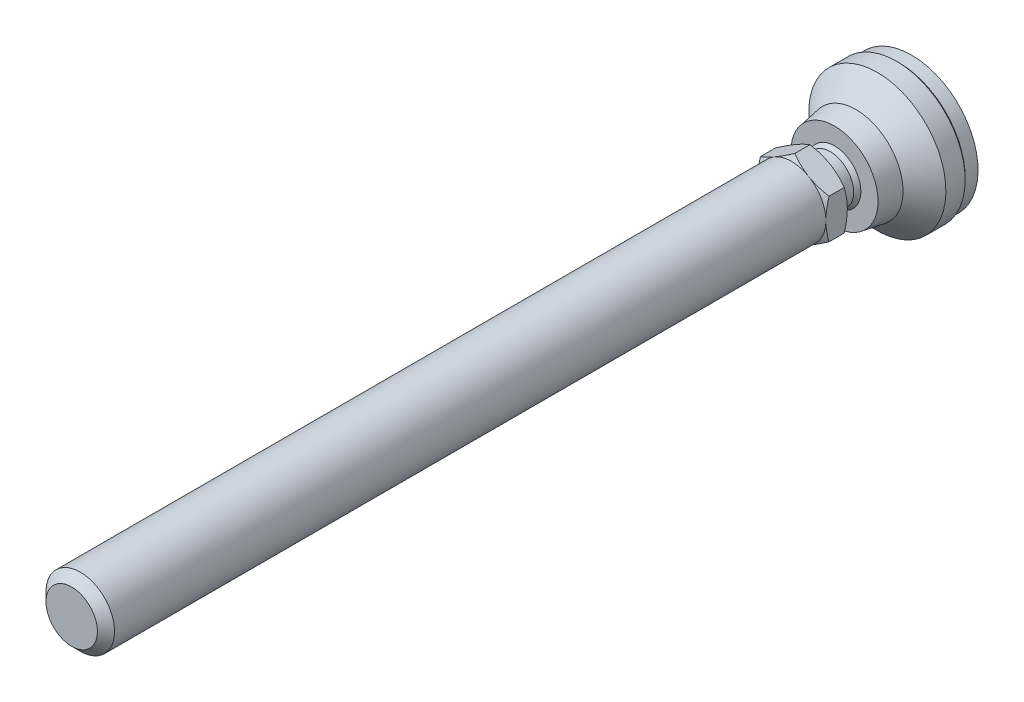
ISO-10303-21;
HEADER;
FILE_DESCRIPTION(('STEP AP214'),'2;1');
FILE_NAME('part.step','',(''),(''),'','','');
FILE_SCHEMA(('AUTOMOTIVE_DESIGN { 1 0 10303 214 1 1 1 1 }'));
ENDSEC;
DATA;
#1=APPLICATION_CONTEXT('core data for automotive mechanical design processes');
#2=APPLICATION_PROTOCOL_DEFINITION('international standard','automotive_design',2000,#1);
#3=PRODUCT_CONTEXT('',#1,'mechanical');
#4=PRODUCT('Part','Part','',(#3));
#5=PRODUCT_RELATED_PRODUCT_CATEGORY('part','',(#4));
#6=PRODUCT_DEFINITION_FORMATION('','',#4);
#7=PRODUCT_DEFINITION_CONTEXT('part definition',#1,'design');
#8=PRODUCT_DEFINITION('design','',#6,#7);
#9=PRODUCT_DEFINITION_SHAPE('','',#8);
#10=(LENGTH_UNIT() NAMED_UNIT(*) SI_UNIT(.MILLI.,.METRE.));
#11=(NAMED_UNIT(*) PLANE_ANGLE_UNIT() SI_UNIT($,.RADIAN.));
#12=(NAMED_UNIT(*) SI_UNIT($,.STERADIAN.) SOLID_ANGLE_UNIT());
#13=UNCERTAINTY_MEASURE_WITH_UNIT(LENGTH_MEASURE(1.E-05),#10,'distance_accuracy_value','');
#14=(GEOMETRIC_REPRESENTATION_CONTEXT(3) GLOBAL_UNCERTAINTY_ASSIGNED_CONTEXT((#13)) GLOBAL_UNIT_ASSIGNED_CONTEXT((#10,
#11,#12)) REPRESENTATION_CONTEXT('',''));
#15=CARTESIAN_POINT('',(0.,0.,0.));
#16=DIRECTION('',(0.,0.,1.));
#17=DIRECTION('',(1.,0.,0.));
#18=AXIS2_PLACEMENT_3D('',#15,#16,#17);
#19=CARTESIAN_POINT('',(-7.7647058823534,0.,23.));
#20=DIRECTION('',(0.,0.,1.));
#21=DIRECTION('',(0.,-1.,0.));
#22=AXIS2_PLACEMENT_3D('',#19,#20,#21);
#23=PLANE('',#22);
#24=CARTESIAN_POINT('',(0.,0.,23.));
#25=DIRECTION('',(0.,0.,-1.));
#26=DIRECTION('',(0.,1.,0.));
#27=AXIS2_PLACEMENT_3D('',#24,#25,#26);
#28=CIRCLE('',#27,5.50000000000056);
#29=CARTESIAN_POINT('',(0.,5.50000000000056,23.));
#30=VERTEX_POINT('',#29);
#31=EDGE_CURVE('E278',#30,#30,#28,.T.);
#32=ORIENTED_EDGE('',*,*,#31,.F.);
#33=EDGE_LOOP('',(#32));
#34=FACE_BOUND('',#33,.T.);
#35=CARTESIAN_POINT('',(0.,0.,23.));
#36=DIRECTION('',(0.,0.,1.));
#37=DIRECTION('',(0.,-1.,0.));
#38=AXIS2_PLACEMENT_3D('',#35,#36,#37);
#39=CIRCLE('',#38,8.);
#40=CARTESIAN_POINT('',(4.,-6.92820323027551,23.));
#41=VERTEX_POINT('',#40);
#42=CARTESIAN_POINT('',(-4.,-6.92820323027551,23.));
#43=VERTEX_POINT('',#42);
#44=EDGE_CURVE('E17',#41,#43,#39,.F.);
#45=ORIENTED_EDGE('',*,*,#44,.T.);
#46=CARTESIAN_POINT('',(-8.,0.,23.));
#47=VERTEX_POINT('',#46);
#48=EDGE_CURVE('E9',#43,#47,#39,.F.);
#49=ORIENTED_EDGE('',*,*,#48,.T.);
#50=CARTESIAN_POINT('',(-4.,6.92820323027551,23.));
#51=VERTEX_POINT('',#50);
#52=EDGE_CURVE('E22',#47,#51,#39,.F.);
#53=ORIENTED_EDGE('',*,*,#52,.T.);
#54=CARTESIAN_POINT('',(4.,6.92820323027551,23.));
#55=VERTEX_POINT('',#54);
#56=EDGE_CURVE('E417',#51,#55,#39,.F.);
#57=ORIENTED_EDGE('',*,*,#56,.T.);
#58=CARTESIAN_POINT('',(8.,0.,23.));
#59=VERTEX_POINT('',#58);
#60=EDGE_CURVE('E120',#55,#59,#39,.F.);
#61=ORIENTED_EDGE('',*,*,#60,.T.);
#62=CARTESIAN_POINT('',(0.,0.,23.));
#63=DIRECTION('',(0.,0.,1.));
#64=DIRECTION('',(0.,-1.,0.));
#65=AXIS2_PLACEMENT_3D('',#62,#63,#64);
#66=CIRCLE('',#65,8.);
#67=EDGE_CURVE('E104',#41,#59,#66,.T.);
#68=ORIENTED_EDGE('',*,*,#67,.F.);
#69=EDGE_LOOP('',(#45,#49,#53,#57,#61,#68));
#70=FACE_BOUND('',#69,.T.);
#71=ADVANCED_FACE('F14',(#34,#70),#23,.F.);
#72=CARTESIAN_POINT('',(0.,0.,3.));
#73=DIRECTION('',(0.,0.,-1.));
#74=DIRECTION('',(0.,1.,0.));
#75=AXIS2_PLACEMENT_3D('',#72,#73,#74);
#76=CYLINDRICAL_SURFACE('',#75,5.50000000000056);
#77=CARTESIAN_POINT('',(0.,0.,18.9999999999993));
#78=DIRECTION('',(0.,0.,-1.));
#79=DIRECTION('',(0.,1.,0.));
#80=AXIS2_PLACEMENT_3D('',#77,#78,#79);
#81=CIRCLE('',#80,5.50000000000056);
#82=CARTESIAN_POINT('',(0.,-5.50000000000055,18.9999999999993));
#83=VERTEX_POINT('',#82);
#84=EDGE_CURVE('E242',#83,#83,#81,.T.);
#85=ORIENTED_EDGE('',*,*,#84,.F.);
#86=EDGE_LOOP('',(#85));
#87=FACE_BOUND('',#86,.T.);
#88=ORIENTED_EDGE('',*,*,#31,.T.);
#89=EDGE_LOOP('',(#88));
#90=FACE_BOUND('',#89,.T.);
#91=ADVANCED_FACE('F346',(#87,#90),#76,.T.);
#92=CARTESIAN_POINT('',(0.,0.,14.6698729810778));
#93=DIRECTION('',(0.,0.,-1.));
#94=DIRECTION('',(0.,-1.,0.));
#95=AXIS2_PLACEMENT_3D('',#92,#93,#94);
#96=SPHERICAL_SURFACE('',#95,7.);
#97=CARTESIAN_POINT('',(0.,0.,18.));
#98=DIRECTION('',(0.,0.,-1.));
#99=DIRECTION('',(0.,1.,0.));
#100=AXIS2_PLACEMENT_3D('',#97,#98,#99);
#101=CIRCLE('',#100,6.15713034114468);
#102=CARTESIAN_POINT('',(0.,-6.15713034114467,18.));
#103=VERTEX_POINT('',#102);
#104=EDGE_CURVE('E246',#103,#103,#101,.T.);
#105=CARTESIAN_POINT('',(0.,-5.50000000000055,18.9999999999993));
#106=CARTESIAN_POINT('',(0.,-5.50771979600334,18.9901945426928));
#107=CARTESIAN_POINT('',(0.,-5.51541336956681,18.9803684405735));
#108=CARTESIAN_POINT('',(0.,-5.53074785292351,18.9606752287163));
#109=CARTESIAN_POINT('',(0.,-5.53838876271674,18.9508081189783));
#110=CARTESIAN_POINT('',(0.,-5.55361769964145,18.9310331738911));
#111=CARTESIAN_POINT('',(0.,-5.56120572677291,18.9211253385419));
#112=CARTESIAN_POINT('',(0.,-5.57632868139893,18.9012692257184));
#113=CARTESIAN_POINT('',(0.,-5.58386360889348,18.8913209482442));
#114=CARTESIAN_POINT('',(0.,-5.59888014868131,18.8713842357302));
#115=CARTESIAN_POINT('',(0.,-5.60636176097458,18.8613958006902));
#116=CARTESIAN_POINT('',(0.,-5.62127145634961,18.8413790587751));
#117=CARTESIAN_POINT('',(0.,-5.62869953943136,18.8313507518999));
#118=CARTESIAN_POINT('',(0.,-5.64350196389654,18.8112545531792));
#119=CARTESIAN_POINT('',(0.,-5.65087630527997,18.8011866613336));
#120=CARTESIAN_POINT('',(0.,-5.66557103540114,18.7810115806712));
#121=CARTESIAN_POINT('',(0.,-5.67289142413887,18.7709043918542));
#122=CARTESIAN_POINT('',(0.,-5.68747803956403,18.7506510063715));
#123=CARTESIAN_POINT('',(0.,-5.69474426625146,18.7405048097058));
#124=CARTESIAN_POINT('',(0.,-5.70922234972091,18.7201736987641));
#125=CARTESIAN_POINT('',(0.,-5.71643420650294,18.7099887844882));
#126=CARTESIAN_POINT('',(0.,-5.73080334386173,18.6895805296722));
#127=CARTESIAN_POINT('',(0.,-5.73796062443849,18.6793571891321));
#128=CARTESIAN_POINT('',(0.,-5.75222040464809,18.6588723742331));
#129=CARTESIAN_POINT('',(0.,-5.75932290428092,18.6486108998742));
#130=CARTESIAN_POINT('',(0.,-5.77347291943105,18.6280501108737));
#131=CARTESIAN_POINT('',(0.,-5.78052043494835,18.6177507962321));
#132=CARTESIAN_POINT('',(0.,-5.79456028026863,18.5971146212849));
#133=CARTESIAN_POINT('',(0.,-5.80155261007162,18.5867777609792));
#134=CARTESIAN_POINT('',(0.,-5.81548188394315,18.5660667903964));
#135=CARTESIAN_POINT('',(0.,-5.82241882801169,18.5556926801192));
#136=CARTESIAN_POINT('',(0.,-5.83623713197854,18.5349075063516));
#137=CARTESIAN_POINT('',(0.,-5.84311849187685,18.5244964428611));
#138=CARTESIAN_POINT('',(0.,-5.85682543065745,18.503637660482));
#139=CARTESIAN_POINT('',(0.,-5.86365100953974,18.4931899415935));
#140=CARTESIAN_POINT('',(0.,-5.8772461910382,18.4722581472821));
#141=CARTESIAN_POINT('',(0.,-5.88401579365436,18.4617740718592));
#142=CARTESIAN_POINT('',(0.,-5.89749882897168,18.440769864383));
#143=CARTESIAN_POINT('',(0.,-5.90421226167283,18.4302497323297));
#144=CARTESIAN_POINT('',(0.,-5.91758276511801,18.4091737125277));
#145=CARTESIAN_POINT('',(0.,-5.92423983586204,18.398617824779));
#146=CARTESIAN_POINT('',(0.,-5.93749742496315,18.3774705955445));
#147=CARTESIAN_POINT('',(0.,-5.94409794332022,18.3668792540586));
#148=CARTESIAN_POINT('',(0.,-5.9572422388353,18.3456614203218));
#149=CARTESIAN_POINT('',(0.,-5.96378601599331,18.3350349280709));
#150=CARTESIAN_POINT('',(0.,-5.97681664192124,18.3137470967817));
#151=CARTESIAN_POINT('',(0.,-5.98330349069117,18.3030857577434));
#152=CARTESIAN_POINT('',(0.,-5.99622007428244,18.2817285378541));
#153=CARTESIAN_POINT('',(0.,-6.00264980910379,18.271032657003));
#154=CARTESIAN_POINT('',(0.,-6.0154519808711,18.2496066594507));
#155=CARTESIAN_POINT('',(0.,-6.02182441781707,18.2388765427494));
#156=CARTESIAN_POINT('',(0.,-6.03451181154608,18.2173823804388));
#157=CARTESIAN_POINT('',(0.,-6.04082676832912,18.2066183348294));
#158=CARTESIAN_POINT('',(0.,-6.05339902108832,18.1850566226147));
#159=CARTESIAN_POINT('',(0.,-6.05965631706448,18.1742589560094));
#160=CARTESIAN_POINT('',(0.,-6.07211306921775,18.1526303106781));
#161=CARTESIAN_POINT('',(0.,-6.07831252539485,18.1417993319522));
#162=CARTESIAN_POINT('',(0.,-6.09065342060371,18.1201043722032));
#163=CARTESIAN_POINT('',(0.,-6.09679485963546,18.1092403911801));
#164=CARTESIAN_POINT('',(0.,-6.10901954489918,18.0874797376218));
#165=CARTESIAN_POINT('',(0.,-6.11510279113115,18.0765830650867));
#166=CARTESIAN_POINT('',(0.,-6.12721091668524,18.0547573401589));
#167=CARTESIAN_POINT('',(0.,-6.13323579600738,18.0438282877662));
#168=CARTESIAN_POINT('',(0.,-6.14522701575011,18.0219381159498));
#169=CARTESIAN_POINT('',(0.,-6.15119335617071,18.010976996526));
#170=CARTESIAN_POINT('',(0.,-6.15713034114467,18.));
#171=B_SPLINE_CURVE_WITH_KNOTS('',3,(#105,#106,#107,#108,#109,#110,#111,#112,#113,#114,#115,
#116,#117,#118,#119,#120,#121,#122,#123,#124,#125,#126,#127,#128,#129,#130,#131,#132,#133,#134,
#135,#136,#137,#138,#139,#140,#141,#142,#143,#144,#145,#146,#147,#148,#149,#150,#151,#152,#153,
#154,#155,#156,#157,#158,#159,#160,#161,#162,#163,#164,#165,#166,#167,#168,#169,#170),
.UNSPECIFIED.,.F.,.F.,(4,2,2,2,2,2,2,2,2,2,2,2,2,2,2,2,2,2,2,2,2,2,2,2,2,2,2,2,2,2,2,2,4),(0.,
0.0374389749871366,0.0748779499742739,0.112316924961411,0.149755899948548,0.187194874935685,
0.224633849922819,0.262072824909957,0.299511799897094,0.336950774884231,0.374389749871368,
0.411828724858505,0.449267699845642,0.486706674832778,0.524145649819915,0.56158462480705,
0.599023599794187,0.636462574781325,0.67390154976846,0.711340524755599,0.748779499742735,
0.786218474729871,0.823657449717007,0.861096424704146,0.898535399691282,0.93597437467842,
0.973413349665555,1.01085232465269,1.04829129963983,1.08573027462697,1.1231692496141,
1.16060822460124,1.19804719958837),.UNSPECIFIED.);
#172=EDGE_CURVE('BSEAM342',#83,#103,#171,.T.);
#173=ORIENTED_EDGE('',*,*,#84,.T.);
#174=ORIENTED_EDGE('',*,*,#104,.F.);
#175=ORIENTED_EDGE('',*,*,#172,.T.);
#176=ORIENTED_EDGE('',*,*,#172,.F.);
#177=EDGE_LOOP('',(#173,#175,#174,#176));
#178=FACE_BOUND('',#177,.T.);
#179=ADVANCED_FACE('F342',(#178),#96,.T.);
#180=CARTESIAN_POINT('',(0.,0.,3.50000000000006));
#181=DIRECTION('',(0.,0.,1.));
#182=DIRECTION('',(0.,-1.,0.));
#183=AXIS2_PLACEMENT_3D('',#180,#181,#182);
#184=CONICAL_SURFACE('',#183,16.,0.785398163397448);
#185=CARTESIAN_POINT('',(0.,0.,3.));
#186=DIRECTION('',(0.,0.,-1.));
#187=DIRECTION('',(0.,1.,0.));
#188=AXIS2_PLACEMENT_3D('',#185,#186,#187);
#189=CIRCLE('',#188,15.5);
#190=CARTESIAN_POINT('',(0.,15.5,3.));
#191=VERTEX_POINT('',#190);
#192=EDGE_CURVE('E267',#191,#191,#189,.T.);
#193=ORIENTED_EDGE('',*,*,#192,.F.);
#194=EDGE_LOOP('',(#193));
#195=FACE_BOUND('',#194,.T.);
#196=CARTESIAN_POINT('',(0.,0.,3.50000000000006));
#197=DIRECTION('',(0.,0.,-1.));
#198=DIRECTION('',(0.,1.,0.));
#199=AXIS2_PLACEMENT_3D('',#196,#197,#198);
#200=CIRCLE('',#199,16.);
#201=CARTESIAN_POINT('',(0.,16.,3.50000000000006));
#202=VERTEX_POINT('',#201);
#203=EDGE_CURVE('E270',#202,#202,#200,.T.);
#204=ORIENTED_EDGE('',*,*,#203,.T.);
#205=EDGE_LOOP('',(#204));
#206=FACE_BOUND('',#205,.T.);
#207=ADVANCED_FACE('F345',(#195,#206),#184,.T.);
#208=CARTESIAN_POINT('',(0.,0.,3.));
#209=DIRECTION('',(0.,0.,-1.));
#210=DIRECTION('',(0.,1.,0.));
#211=AXIS2_PLACEMENT_3D('',#208,#209,#210);
#212=CYLINDRICAL_SURFACE('',#211,16.);
#213=ORIENTED_EDGE('',*,*,#203,.F.);
#214=EDGE_LOOP('',(#213));
#215=FACE_BOUND('',#214,.T.);
#216=CARTESIAN_POINT('',(0.,0.,8.));
#217=DIRECTION('',(0.,0.,-1.));
#218=DIRECTION('',(0.,1.,0.));
#219=AXIS2_PLACEMENT_3D('',#216,#217,#218);
#220=CIRCLE('',#219,16.);
#221=CARTESIAN_POINT('',(0.,16.,8.));
#222=VERTEX_POINT('',#221);
#223=EDGE_CURVE('E273',#222,#222,#220,.T.);
#224=ORIENTED_EDGE('',*,*,#223,.T.);
#225=EDGE_LOOP('',(#224));
#226=FACE_BOUND('',#225,.T.);
#227=ADVANCED_FACE('F385',(#215,#226),#212,.T.);
#228=CARTESIAN_POINT('',(0.,0.,13.));
#229=DIRECTION('',(0.,0.,-1.));
#230=DIRECTION('',(0.,1.,0.));
#231=AXIS2_PLACEMENT_3D('',#228,#229,#230);
#232=CONICAL_SURFACE('',#231,11.,0.785398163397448);
#233=ORIENTED_EDGE('',*,*,#223,.F.);
#234=EDGE_LOOP('',(#233));
#235=FACE_BOUND('',#234,.T.);
#236=CARTESIAN_POINT('',(0.,0.,13.));
#237=DIRECTION('',(0.,0.,-1.));
#238=DIRECTION('',(0.,1.,0.));
#239=AXIS2_PLACEMENT_3D('',#236,#237,#238);
#240=CIRCLE('',#239,11.);
#241=CARTESIAN_POINT('',(0.,11.,13.));
#242=VERTEX_POINT('',#241);
#243=EDGE_CURVE('E276',#242,#242,#240,.T.);
#244=ORIENTED_EDGE('',*,*,#243,.T.);
#245=EDGE_LOOP('',(#244));
#246=FACE_BOUND('',#245,.T.);
#247=ADVANCED_FACE('F381',(#235,#246),#232,.T.);
#248=CARTESIAN_POINT('',(0.,0.,19.));
#249=DIRECTION('',(0.,0.,-1.));
#250=DIRECTION('',(0.,1.,0.));
#251=AXIS2_PLACEMENT_3D('',#248,#249,#250);
#252=CONICAL_SURFACE('',#251,10.,0.165148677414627);
#253=CARTESIAN_POINT('',(0.,0.,18.));
#254=DIRECTION('',(0.,0.,1.));
#255=DIRECTION('',(0.,-1.,0.));
#256=AXIS2_PLACEMENT_3D('',#253,#254,#255);
#257=CIRCLE('',#256,10.1666666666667);
#258=CARTESIAN_POINT('',(0.,-10.1666666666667,18.));
#259=VERTEX_POINT('',#258);
#260=EDGE_CURVE('E249',#259,#259,#257,.T.);
#261=ORIENTED_EDGE('',*,*,#260,.F.);
#262=EDGE_LOOP('',(#261));
#263=FACE_BOUND('',#262,.T.);
#264=ORIENTED_EDGE('',*,*,#243,.F.);
#265=EDGE_LOOP('',(#264));
#266=FACE_BOUND('',#265,.T.);
#267=ADVANCED_FACE('F340',(#263,#266),#252,.T.);
#268=CARTESIAN_POINT('',(-6.60079601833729,0.,18.));
#269=DIRECTION('',(0.,0.,-1.));
#270=DIRECTION('',(0.,1.,0.));
#271=AXIS2_PLACEMENT_3D('',#268,#269,#270);
#272=PLANE('',#271);
#273=ORIENTED_EDGE('',*,*,#260,.T.);
#274=EDGE_LOOP('',(#273));
#275=FACE_BOUND('',#274,.T.);
#276=ORIENTED_EDGE('',*,*,#104,.T.);
#277=EDGE_LOOP('',(#276));
#278=FACE_BOUND('',#277,.T.);
#279=ADVANCED_FACE('F335',(#275,#278),#272,.F.);
#280=CARTESIAN_POINT('',(0.,0.,0.));
#281=DIRECTION('',(0.,0.,1.));
#282=DIRECTION('',(0.,-1.,0.));
#283=AXIS2_PLACEMENT_3D('',#280,#281,#282);
#284=CYLINDRICAL_SURFACE('',#283,15.5);
#285=CARTESIAN_POINT('',(0.,0.,0.));
#286=DIRECTION('',(0.,0.,-1.));
#287=DIRECTION('',(0.,1.,0.));
#288=AXIS2_PLACEMENT_3D('',#285,#286,#287);
#289=CIRCLE('',#288,15.5);
#290=CARTESIAN_POINT('',(0.,15.5,0.));
#291=VERTEX_POINT('',#290);
#292=EDGE_CURVE('E230',#291,#291,#289,.T.);
#293=ORIENTED_EDGE('',*,*,#292,.F.);
#294=EDGE_LOOP('',(#293));
#295=FACE_BOUND('',#294,.T.);
#296=ORIENTED_EDGE('',*,*,#192,.T.);
#297=EDGE_LOOP('',(#296));
#298=FACE_BOUND('',#297,.T.);
#299=ADVANCED_FACE('F339',(#295,#298),#284,.T.);
#300=CARTESIAN_POINT('',(0.,0.,0.));
#301=DIRECTION('',(0.,0.,-1.));
#302=DIRECTION('',(0.,1.,0.));
#303=AXIS2_PLACEMENT_3D('',#300,#301,#302);
#304=PLANE('',#303);
#305=ORIENTED_EDGE('',*,*,#292,.T.);
#306=EDGE_LOOP('',(#305));
#307=FACE_BOUND('',#306,.T.);
#308=ADVANCED_FACE('F358',(#307),#304,.T.);
#309=CARTESIAN_POINT('',(0.,0.,23.));
#310=DIRECTION('',(0.,0.,1.));
#311=DIRECTION('',(0.,-1.,0.));
#312=AXIS2_PLACEMENT_3D('',#309,#310,#311);
#313=CONICAL_SURFACE('',#312,8.,1.0471975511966);
#314=ORIENTED_EDGE('',*,*,#44,.F.);
#315=CARTESIAN_POINT('',(-0.000199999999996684,-9.23771977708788,23.714597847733));
#316=CARTESIAN_POINT('',(0.175648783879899,-9.13619343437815,23.6559907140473));
#317=CARTESIAN_POINT('',(0.352153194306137,-9.03428856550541,23.6000434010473));
#318=CARTESIAN_POINT('',(0.706595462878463,-8.82965122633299,23.4942010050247));
#319=CARTESIAN_POINT('',(0.884533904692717,-8.72691841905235,23.4443085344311));
#320=CARTESIAN_POINT('',(1.42119823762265,-8.41707512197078,23.3046927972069));
#321=CARTESIAN_POINT('',(1.78204258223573,-8.20874154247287,23.2252811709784));
#322=CARTESIAN_POINT('',(2.32203917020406,-7.89697436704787,23.1321616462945));
#323=CARTESIAN_POINT('',(2.49957818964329,-7.79447216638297,23.1056345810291));
#324=CARTESIAN_POINT('',(2.85545911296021,-7.5890042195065,23.0611531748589));
#325=CARTESIAN_POINT('',(3.03380094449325,-7.48603851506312,23.0431980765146));
#326=CARTESIAN_POINT('',(3.39079168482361,-7.27992981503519,23.0163156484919));
#327=CARTESIAN_POINT('',(3.56944001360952,-7.17678715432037,23.0073780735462));
#328=CARTESIAN_POINT('',(3.9269017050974,-6.97040655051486,22.9987223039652));
#329=CARTESIAN_POINT('',(4.10571506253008,-6.8671686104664,22.9990038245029));
#330=CARTESIAN_POINT('',(4.44001336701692,-6.67416139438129,23.0081450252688));
#331=CARTESIAN_POINT('',(4.59552190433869,-6.58437849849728,23.0158896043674));
#332=CARTESIAN_POINT('',(4.90617476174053,-6.4050229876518,23.0382011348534));
#333=CARTESIAN_POINT('',(5.06131905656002,-6.31545038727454,23.0527685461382));
#334=CARTESIAN_POINT('',(5.52615131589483,-6.04707935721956,23.1063606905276));
#335=CARTESIAN_POINT('',(5.83501648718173,-5.86875596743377,23.1552686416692));
#336=CARTESIAN_POINT('',(6.45602322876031,-5.5102175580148,23.2775394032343));
#337=CARTESIAN_POINT('',(6.76808554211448,-5.33004829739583,23.351420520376));
#338=CARTESIAN_POINT('',(7.38755648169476,-4.97239658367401,23.519100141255));
#339=CARTESIAN_POINT('',(7.69497304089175,-4.79490955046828,23.6128592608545));
#340=CARTESIAN_POINT('',(8.0002,-4.6186866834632,23.714597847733));
#341=B_SPLINE_CURVE_WITH_KNOTS('',3,(#315,#316,#317,#318,#319,#320,#321,#322,#323,#324,#325,
#326,#327,#328,#329,#330,#331,#332,#333,#334,#335,#336,#337,#338,#339,#340),.UNSPECIFIED.,.F.,
.F.,(4,2,2,2,2,2,2,2,2,2,2,2,4),(0.,0.633973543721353,1.26821965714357,2.53934712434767,
3.1593434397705,3.77928496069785,4.39852133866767,5.01773858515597,5.55680239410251,
6.09590254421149,7.17487077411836,8.27776850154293,9.37850115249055),.UNSPECIFIED.);
#342=CARTESIAN_POINT('',(0.,-9.23760430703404,23.7145311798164));
#343=VERTEX_POINT('',#342);
#344=EDGE_CURVE('E112',#343,#41,#341,.T.);
#345=ORIENTED_EDGE('',*,*,#344,.F.);
#346=CARTESIAN_POINT('',(-8.0002,-4.6186866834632,23.714597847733));
#347=CARTESIAN_POINT('',(-7.82435121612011,-4.72021302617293,23.6559907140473));
#348=CARTESIAN_POINT('',(-7.64784680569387,-4.82211789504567,23.6000434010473));
#349=CARTESIAN_POINT('',(-7.29340453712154,-5.02675523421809,23.4942010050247));
#350=CARTESIAN_POINT('',(-7.11546609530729,-5.12948804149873,23.4443085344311));
#351=CARTESIAN_POINT('',(-6.57880176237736,-5.4393313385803,23.3046927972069));
#352=CARTESIAN_POINT('',(-6.21795741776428,-5.64766491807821,23.2252811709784));
#353=CARTESIAN_POINT('',(-5.67796082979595,-5.9594320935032,23.1321616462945));
#354=CARTESIAN_POINT('',(-5.50042181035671,-6.06193429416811,23.1056345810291));
#355=CARTESIAN_POINT('',(-5.1445408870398,-6.26740224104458,23.0611531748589));
#356=CARTESIAN_POINT('',(-4.96619905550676,-6.37036794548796,23.0431980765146));
#357=CARTESIAN_POINT('',(-4.6092083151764,-6.57647664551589,23.0163156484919));
#358=CARTESIAN_POINT('',(-4.43055998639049,-6.67961930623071,23.0073780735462));
#359=CARTESIAN_POINT('',(-4.07309829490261,-6.88599991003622,22.9987223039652));
#360=CARTESIAN_POINT('',(-3.89428493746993,-6.98923785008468,22.9990038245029));
#361=CARTESIAN_POINT('',(-3.55998663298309,-7.1822450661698,23.0081450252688));
#362=CARTESIAN_POINT('',(-3.40447809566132,-7.2720279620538,23.0158896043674));
#363=CARTESIAN_POINT('',(-3.09382523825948,-7.45138347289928,23.0382011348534));
#364=CARTESIAN_POINT('',(-2.93868094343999,-7.54095607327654,23.0527685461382));
#365=CARTESIAN_POINT('',(-2.47384868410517,-7.80932710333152,23.1063606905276));
#366=CARTESIAN_POINT('',(-2.16498351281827,-7.98765049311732,23.1552686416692));
#367=CARTESIAN_POINT('',(-1.54397677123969,-8.34618890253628,23.2775394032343));
#368=CARTESIAN_POINT('',(-1.23191445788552,-8.52635816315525,23.351420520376));
#369=CARTESIAN_POINT('',(-0.612443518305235,-8.88400987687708,23.519100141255));
#370=CARTESIAN_POINT('',(-0.305026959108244,-9.06149691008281,23.6128592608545));
#371=CARTESIAN_POINT('',(0.000200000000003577,-9.23771977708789,23.714597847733));
#372=B_SPLINE_CURVE_WITH_KNOTS('',3,(#346,#347,#348,#349,#350,#351,#352,#353,#354,#355,#356,
#357,#358,#359,#360,#361,#362,#363,#364,#365,#366,#367,#368,#369,#370,#371),.UNSPECIFIED.,.F.,
.F.,(4,2,2,2,2,2,2,2,2,2,2,2,4),(0.,0.633973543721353,1.26821965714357,2.53934712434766,
3.1593434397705,3.77928496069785,4.39852133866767,5.01773858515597,5.5568023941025,
6.09590254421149,7.17487077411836,8.27776850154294,9.37850115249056),.UNSPECIFIED.);
#373=EDGE_CURVE('E118',#43,#343,#372,.T.);
#374=ORIENTED_EDGE('',*,*,#373,.F.);
#375=EDGE_LOOP('',(#314,#345,#374));
#376=FACE_BOUND('',#375,.T.);
#377=ADVANCED_FACE('F116',(#376),#313,.T.);
#378=ORIENTED_EDGE('',*,*,#67,.T.);
#379=CARTESIAN_POINT('',(8.,12.3327398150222,26.8683738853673));
#380=CARTESIAN_POINT('',(8.,11.9839445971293,26.6994755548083));
#381=CARTESIAN_POINT('',(7.99999999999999,11.6343407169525,26.532218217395));
#382=CARTESIAN_POINT('',(7.99999999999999,10.9330852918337,26.2019099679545));
#383=CARTESIAN_POINT('',(7.99999999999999,10.5814334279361,26.0388597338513));
#384=CARTESIAN_POINT('',(7.99999999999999,9.87380408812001,25.7170539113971));
#385=CARTESIAN_POINT('',(7.99999999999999,9.51781343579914,25.5583271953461));
#386=CARTESIAN_POINT('',(7.99999999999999,8.80297479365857,25.2474688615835));
#387=CARTESIAN_POINT('',(7.99999999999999,8.44412694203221,25.0953369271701));
#388=CARTESIAN_POINT('',(7.99999999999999,7.71170002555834,24.794773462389));
#389=CARTESIAN_POINT('',(7.99999999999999,7.33801156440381,24.6466070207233));
#390=CARTESIAN_POINT('',(7.99999999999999,6.58623639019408,24.361667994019));
#391=CARTESIAN_POINT('',(8.,6.20814918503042,24.2248966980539));
#392=CARTESIAN_POINT('',(8.,5.44770239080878,23.9663933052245));
#393=CARTESIAN_POINT('',(7.99999999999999,5.06535348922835,23.8446301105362));
#394=CARTESIAN_POINT('',(8.,4.29518584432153,23.6200970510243));
#395=CARTESIAN_POINT('',(8.,3.90736888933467,23.5173211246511));
#396=CARTESIAN_POINT('',(8.,3.12812290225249,23.3362941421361));
#397=CARTESIAN_POINT('',(8.,2.73672502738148,23.257912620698));
#398=CARTESIAN_POINT('',(8.,2.14612389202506,23.1620651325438));
#399=CARTESIAN_POINT('',(8.,1.9486576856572,23.1337354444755));
#400=CARTESIAN_POINT('',(8.,1.55276912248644,23.0848749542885));
#401=CARTESIAN_POINT('',(8.,1.35434685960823,23.0643434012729));
#402=CARTESIAN_POINT('',(8.,0.959371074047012,23.0317418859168));
#403=CARTESIAN_POINT('',(8.,0.762826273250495,23.0195666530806));
#404=CARTESIAN_POINT('',(8.,0.369398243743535,23.0035333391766));
#405=CARTESIAN_POINT('',(8.,0.172515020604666,22.9996751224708));
#406=CARTESIAN_POINT('',(8.,-0.221238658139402,23.0003677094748));
#407=CARTESIAN_POINT('',(8.,-0.418109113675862,23.004918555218));
#408=CARTESIAN_POINT('',(8.,-0.811485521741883,23.0223193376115));
#409=CARTESIAN_POINT('',(8.,-1.00799145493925,23.0351697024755));
#410=CARTESIAN_POINT('',(8.,-1.48253110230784,23.0759539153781));
#411=CARTESIAN_POINT('',(8.,-1.76022265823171,23.1079519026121));
#412=CARTESIAN_POINT('',(8.,-2.31348265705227,23.1867585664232));
#413=CARTESIAN_POINT('',(8.,-2.58905079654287,23.2335693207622));
#414=CARTESIAN_POINT('',(8.,-3.41229074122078,23.3937331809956));
#415=CARTESIAN_POINT('',(8.,-3.95617701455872,23.5267867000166));
#416=CARTESIAN_POINT('',(8.,-4.76931307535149,23.7567240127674));
#417=CARTESIAN_POINT('',(8.,-5.04280056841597,23.8394771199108));
#418=CARTESIAN_POINT('',(8.,-5.58711810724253,24.0133825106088));
#419=CARTESIAN_POINT('',(8.,-5.85794813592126,24.1045348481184));
#420=CARTESIAN_POINT('',(8.,-6.39703954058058,24.2937925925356));
#421=CARTESIAN_POINT('',(8.,-6.66530177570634,24.3918955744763));
#422=CARTESIAN_POINT('',(8.,-7.19961714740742,24.5939199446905));
#423=CARTESIAN_POINT('',(8.,-7.46567030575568,24.6978412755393));
#424=CARTESIAN_POINT('',(8.,-8.07604531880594,24.9427215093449));
#425=CARTESIAN_POINT('',(8.,-8.41968730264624,25.0853715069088));
#426=CARTESIAN_POINT('',(8.,-9.10418642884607,25.3772206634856));
#427=CARTESIAN_POINT('',(8.,-9.44504342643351,25.5264201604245));
#428=CARTESIAN_POINT('',(8.,-10.1244685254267,25.8301044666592));
#429=CARTESIAN_POINT('',(8.,-10.4630361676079,25.9845903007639));
#430=CARTESIAN_POINT('',(8.,-11.1381838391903,26.2978215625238));
#431=CARTESIAN_POINT('',(8.,-11.4747639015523,26.4565669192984));
#432=CARTESIAN_POINT('',(8.,-12.1465622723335,26.7776941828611));
#433=CARTESIAN_POINT('',(8.,-12.4817790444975,26.940079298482));
#434=CARTESIAN_POINT('',(8.,-13.1507958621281,27.2677446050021));
#435=CARTESIAN_POINT('',(8.,-13.4845958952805,27.4330248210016));
#436=CARTESIAN_POINT('',(8.,-14.4842130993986,27.9324697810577));
#437=CARTESIAN_POINT('',(8.,-15.1482335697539,28.270232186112));
#438=CARTESIAN_POINT('',(8.,-16.1152521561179,28.7684127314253));
#439=CARTESIAN_POINT('',(8.00000000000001,-16.4196441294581,28.9261421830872));
#440=CARTESIAN_POINT('',(8.00000000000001,-17.0277636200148,29.2428653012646));
#441=CARTESIAN_POINT('',(8.00000000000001,-17.331491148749,29.4018589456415));
#442=CARTESIAN_POINT('',(8.00000000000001,-18.2418325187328,29.8804949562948));
#443=CARTESIAN_POINT('',(8.00000000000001,-18.8475822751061,30.201780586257));
#444=CARTESIAN_POINT('',(8.00000000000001,-20.0559009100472,30.8469693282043));
#445=CARTESIAN_POINT('',(8.00000000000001,-20.658473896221,31.1708647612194));
#446=CARTESIAN_POINT('',(8.00000000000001,-21.8621486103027,31.8213062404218));
#447=CARTESIAN_POINT('',(8.00000000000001,-22.463250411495,32.1478521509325));
#448=CARTESIAN_POINT('',(8.,-23.0638053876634,32.4753942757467));
#449=B_SPLINE_CURVE_WITH_KNOTS('',3,(#379,#380,#381,#382,#383,#384,#385,#386,#387,#388,#389,
#390,#391,#392,#393,#394,#395,#396,#397,#398,#399,#400,#401,#402,#403,#404,#405,#406,#407,#408,
#409,#410,#411,#412,#413,#414,#415,#416,#417,#418,#419,#420,#421,#422,#423,#424,#425,#426,#427,
#428,#429,#430,#431,#432,#433,#434,#435,#436,#437,#438,#439,#440,#441,#442,#443,#444,#445,#446,
#447,#448),.UNSPECIFIED.,.F.,.F.,(4,2,2,2,2,2,2,2,2,2,2,2,2,2,2,2,2,2,2,2,2,2,2,2,2,2,2,2,2,2,2,
2,2,2,4),(0.,1.16262487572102,2.32543593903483,3.49470339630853,4.66391463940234,
5.86974198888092,7.07570556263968,8.27912671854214,9.48216302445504,10.6786501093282,
11.2769844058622,11.8752610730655,12.4658552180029,13.056439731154,13.6470271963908,
14.2376451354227,15.0757569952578,15.913986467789,17.5914087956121,18.4485396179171,
19.3056759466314,20.162514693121,21.0193449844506,22.1354764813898,23.2516656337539,
24.3680724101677,25.4844606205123,26.6018750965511,27.7192992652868,29.954193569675,
30.9826853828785,32.0111592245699,34.0681841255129,36.120498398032,38.1727082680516),.UNSPECIFIED.);
#450=CARTESIAN_POINT('',(8.,-4.61880215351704,23.7145311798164));
#451=VERTEX_POINT('',#450);
#452=EDGE_CURVE('E107',#451,#59,#449,.F.);
#453=ORIENTED_EDGE('',*,*,#452,.F.);
#454=EDGE_CURVE('E100',#41,#451,#341,.T.);
#455=ORIENTED_EDGE('',*,*,#454,.F.);
#456=EDGE_LOOP('',(#378,#453,#455));
#457=FACE_BOUND('',#456,.T.);
#458=ADVANCED_FACE('F102',(#457),#313,.T.);
#459=ORIENTED_EDGE('',*,*,#60,.F.);
#460=CARTESIAN_POINT('',(8.0002,4.61868668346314,23.7145978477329));
#461=CARTESIAN_POINT('',(7.8243512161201,4.72021302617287,23.6559907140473));
#462=CARTESIAN_POINT('',(7.64784680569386,4.82211789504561,23.6000434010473));
#463=CARTESIAN_POINT('',(7.29340453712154,5.02675523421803,23.4942010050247));
#464=CARTESIAN_POINT('',(7.11546609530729,5.12948804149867,23.4443085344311));
#465=CARTESIAN_POINT('',(6.57880176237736,5.43933133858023,23.3046927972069));
#466=CARTESIAN_POINT('',(6.21795741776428,5.64766491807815,23.2252811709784));
#467=CARTESIAN_POINT('',(5.67796082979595,5.95943209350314,23.1321616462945));
#468=CARTESIAN_POINT('',(5.50042181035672,6.06193429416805,23.1056345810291));
#469=CARTESIAN_POINT('',(5.1445408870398,6.26740224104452,23.0611531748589));
#470=CARTESIAN_POINT('',(4.96619905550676,6.37036794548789,23.0431980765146));
#471=CARTESIAN_POINT('',(4.60920831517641,6.57647664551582,23.0163156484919));
#472=CARTESIAN_POINT('',(4.4305599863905,6.67961930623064,23.0073780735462));
#473=CARTESIAN_POINT('',(4.07309829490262,6.88599991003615,22.9987223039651));
#474=CARTESIAN_POINT('',(3.89428493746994,6.98923785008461,22.9990038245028));
#475=CARTESIAN_POINT('',(3.5599866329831,7.18224506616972,23.0081450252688));
#476=CARTESIAN_POINT('',(3.40447809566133,7.27202796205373,23.0158896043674));
#477=CARTESIAN_POINT('',(3.09382523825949,7.45138347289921,23.0382011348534));
#478=CARTESIAN_POINT('',(2.93868094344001,7.54095607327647,23.0527685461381));
#479=CARTESIAN_POINT('',(2.47384868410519,7.80932710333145,23.1063606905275));
#480=CARTESIAN_POINT('',(2.16498351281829,7.98765049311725,23.1552686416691));
#481=CARTESIAN_POINT('',(1.54397677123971,8.34618890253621,23.2775394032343));
#482=CARTESIAN_POINT('',(1.23191445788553,8.52635816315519,23.351420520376));
#483=CARTESIAN_POINT('',(0.612443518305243,8.88400987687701,23.519100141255));
#484=CARTESIAN_POINT('',(0.30502695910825,9.06149691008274,23.6128592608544));
#485=CARTESIAN_POINT('',(-0.000200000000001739,9.23771977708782,23.7145978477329));
#486=B_SPLINE_CURVE_WITH_KNOTS('',3,(#460,#461,#462,#463,#464,#465,#466,#467,#468,#469,#470,
#471,#472,#473,#474,#475,#476,#477,#478,#479,#480,#481,#482,#483,#484,#485),.UNSPECIFIED.,.F.,
.F.,(4,2,2,2,2,2,2,2,2,2,2,2,4),(0.,0.633973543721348,1.26821965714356,2.53934712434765,
3.15934343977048,3.77928496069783,4.39852133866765,5.01773858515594,5.55680239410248,
6.09590254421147,7.17487077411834,8.27776850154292,9.37850115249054),.UNSPECIFIED.);
#487=CARTESIAN_POINT('',(8.,4.61880215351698,23.7145311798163));
#488=VERTEX_POINT('',#487);
#489=EDGE_CURVE('E187',#488,#55,#486,.T.);
#490=ORIENTED_EDGE('',*,*,#489,.F.);
#491=EDGE_CURVE('E139',#59,#488,#449,.F.);
#492=ORIENTED_EDGE('',*,*,#491,.F.);
#493=EDGE_LOOP('',(#459,#490,#492));
#494=FACE_BOUND('',#493,.T.);
#495=ADVANCED_FACE('F416',(#494),#313,.T.);
#496=ORIENTED_EDGE('',*,*,#56,.F.);
#497=CARTESIAN_POINT('',(0.000199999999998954,9.23771977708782,23.7145978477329));
#498=CARTESIAN_POINT('',(-0.175648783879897,9.13619343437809,23.6559907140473));
#499=CARTESIAN_POINT('',(-0.352153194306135,9.03428856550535,23.6000434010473));
#500=CARTESIAN_POINT('',(-0.706595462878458,8.82965122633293,23.4942010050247));
#501=CARTESIAN_POINT('',(-0.884533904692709,8.72691841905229,23.4443085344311));
#502=CARTESIAN_POINT('',(-1.42119823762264,8.41707512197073,23.3046927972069));
#503=CARTESIAN_POINT('',(-1.78204258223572,8.20874154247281,23.2252811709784));
#504=CARTESIAN_POINT('',(-2.32203917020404,7.89697436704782,23.1321616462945));
#505=CARTESIAN_POINT('',(-2.49957818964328,7.79447216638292,23.1056345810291));
#506=CARTESIAN_POINT('',(-2.85545911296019,7.58900421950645,23.0611531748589));
#507=CARTESIAN_POINT('',(-3.03380094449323,7.48603851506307,23.0431980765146));
#508=CARTESIAN_POINT('',(-3.39079168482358,7.27992981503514,23.0163156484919));
#509=CARTESIAN_POINT('',(-3.56944001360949,7.17678715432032,23.0073780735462));
#510=CARTESIAN_POINT('',(-3.92690170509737,6.97040655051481,22.9987223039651));
#511=CARTESIAN_POINT('',(-4.10571506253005,6.86716861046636,22.9990038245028));
#512=CARTESIAN_POINT('',(-4.44001336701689,6.67416139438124,23.0081450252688));
#513=CARTESIAN_POINT('',(-4.59552190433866,6.58437849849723,23.0158896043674));
#514=CARTESIAN_POINT('',(-4.9061747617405,6.40502298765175,23.0382011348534));
#515=CARTESIAN_POINT('',(-5.06131905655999,6.31545038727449,23.0527685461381));
#516=CARTESIAN_POINT('',(-5.52615131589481,6.04707935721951,23.1063606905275));
#517=CARTESIAN_POINT('',(-5.83501648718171,5.86875596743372,23.1552686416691));
#518=CARTESIAN_POINT('',(-6.45602322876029,5.51021755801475,23.2775394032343));
#519=CARTESIAN_POINT('',(-6.76808554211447,5.33004829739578,23.351420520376));
#520=CARTESIAN_POINT('',(-7.38755648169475,4.97239658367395,23.519100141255));
#521=CARTESIAN_POINT('',(-7.69497304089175,4.79490955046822,23.6128592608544));
#522=CARTESIAN_POINT('',(-8.0002,4.61868668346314,23.7145978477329));
#523=B_SPLINE_CURVE_WITH_KNOTS('',3,(#497,#498,#499,#500,#501,#502,#503,#504,#505,#506,#507,
#508,#509,#510,#511,#512,#513,#514,#515,#516,#517,#518,#519,#520,#521,#522),.UNSPECIFIED.,.F.,
.F.,(4,2,2,2,2,2,2,2,2,2,2,2,4),(0.,0.633973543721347,1.26821965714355,2.53934712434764,
3.15934343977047,3.77928496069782,4.39852133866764,5.01773858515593,5.55680239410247,
6.09590254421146,7.17487077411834,8.27776850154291,9.37850115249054),.UNSPECIFIED.);
#524=CARTESIAN_POINT('',(0.,9.23760430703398,23.7145311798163));
#525=VERTEX_POINT('',#524);
#526=EDGE_CURVE('E188',#525,#51,#523,.T.);
#527=ORIENTED_EDGE('',*,*,#526,.F.);
#528=EDGE_CURVE('E180',#55,#525,#486,.T.);
#529=ORIENTED_EDGE('',*,*,#528,.F.);
#530=EDGE_LOOP('',(#496,#527,#529));
#531=FACE_BOUND('',#530,.T.);
#532=ADVANCED_FACE('F423',(#531),#313,.T.);
#533=ORIENTED_EDGE('',*,*,#52,.F.);
#534=CARTESIAN_POINT('',(-8.,12.3327398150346,26.8683738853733));
#535=CARTESIAN_POINT('',(-8.,11.9839445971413,26.699475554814));
#536=CARTESIAN_POINT('',(-8.,11.634340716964,26.5322182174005));
#537=CARTESIAN_POINT('',(-8.,10.9330852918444,26.2019099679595));
#538=CARTESIAN_POINT('',(-8.,10.5814334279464,26.038859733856));
#539=CARTESIAN_POINT('',(-8.,9.87380408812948,25.7170539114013));
#540=CARTESIAN_POINT('',(-8.,9.5178134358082,25.5583271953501));
#541=CARTESIAN_POINT('',(-8.,8.80297479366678,25.247468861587));
#542=CARTESIAN_POINT('',(-8.,8.44412694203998,25.0953369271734));
#543=CARTESIAN_POINT('',(-8.,7.71170002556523,24.7947734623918));
#544=CARTESIAN_POINT('',(-8.,7.33801156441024,24.6466070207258));
#545=CARTESIAN_POINT('',(-8.,6.58623639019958,24.361667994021));
#546=CARTESIAN_POINT('',(-8.,6.20814918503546,24.2248966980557));
#547=CARTESIAN_POINT('',(-8.,5.44770239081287,23.9663933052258));
#548=CARTESIAN_POINT('',(-8.,5.06535348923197,23.8446301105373));
#549=CARTESIAN_POINT('',(-8.,4.29518584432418,23.620097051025));
#550=CARTESIAN_POINT('',(-8.,3.90736888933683,23.5173211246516));
#551=CARTESIAN_POINT('',(-8.,3.12812290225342,23.3362941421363));
#552=CARTESIAN_POINT('',(-8.,2.73672502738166,23.257912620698));
#553=CARTESIAN_POINT('',(-8.,2.14612389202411,23.1620651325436));
#554=CARTESIAN_POINT('',(-8.,1.94865768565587,23.1337354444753));
#555=CARTESIAN_POINT('',(-8.,1.55276912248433,23.0848749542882));
#556=CARTESIAN_POINT('',(-8.,1.35434685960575,23.0643434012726));
#557=CARTESIAN_POINT('',(-8.,0.95937107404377,23.0317418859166));
#558=CARTESIAN_POINT('',(-8.,0.762826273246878,23.0195666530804));
#559=CARTESIAN_POINT('',(-8.,0.369398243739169,23.0035333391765));
#560=CARTESIAN_POINT('',(-8.,0.172515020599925,22.9996751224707));
#561=CARTESIAN_POINT('',(-8.,-0.221238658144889,23.0003677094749));
#562=CARTESIAN_POINT('',(-8.,-0.418109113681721,23.0049185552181));
#563=CARTESIAN_POINT('',(-8.,-0.81148552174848,23.0223193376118));
#564=CARTESIAN_POINT('',(-8.,-1.00799145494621,23.035169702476));
#565=CARTESIAN_POINT('',(-8.,-1.48253110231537,23.0759539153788));
#566=CARTESIAN_POINT('',(-8.,-1.76022265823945,23.107951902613));
#567=CARTESIAN_POINT('',(-8.,-2.31348265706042,23.1867585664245));
#568=CARTESIAN_POINT('',(-8.,-2.58905079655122,23.2335693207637));
#569=CARTESIAN_POINT('',(-8.,-3.41229074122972,23.3937331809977));
#570=CARTESIAN_POINT('',(-8.,-3.95617701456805,23.5267867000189));
#571=CARTESIAN_POINT('',(-8.,-4.76931307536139,23.7567240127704));
#572=CARTESIAN_POINT('',(-8.,-5.04280056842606,23.8394771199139));
#573=CARTESIAN_POINT('',(-8.,-5.58711810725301,24.0133825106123));
#574=CARTESIAN_POINT('',(-8.,-5.85794813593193,24.1045348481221));
#575=CARTESIAN_POINT('',(-8.,-6.39703954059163,24.2937925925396));
#576=CARTESIAN_POINT('',(-8.,-6.66530177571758,24.3918955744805));
#577=CARTESIAN_POINT('',(-8.,-7.19961714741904,24.593919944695));
#578=CARTESIAN_POINT('',(-8.,-7.4656703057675,24.6978412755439));
#579=CARTESIAN_POINT('',(-8.,-8.07604531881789,24.9427215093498));
#580=CARTESIAN_POINT('',(-8.,-8.41968730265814,25.0853715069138));
#581=CARTESIAN_POINT('',(-8.,-9.10418642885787,25.3772206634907));
#582=CARTESIAN_POINT('',(-8.,-9.44504342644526,25.5264201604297));
#583=CARTESIAN_POINT('',(-8.,-10.1244685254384,25.8301044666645));
#584=CARTESIAN_POINT('',(-8.,-10.4630361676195,25.9845903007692));
#585=CARTESIAN_POINT('',(-8.,-11.1381838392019,26.2978215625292));
#586=CARTESIAN_POINT('',(-8.,-11.4747639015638,26.4565669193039));
#587=CARTESIAN_POINT('',(-8.,-12.1465622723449,26.7776941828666));
#588=CARTESIAN_POINT('',(-8.,-12.4817790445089,26.9400792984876));
#589=CARTESIAN_POINT('',(-8.,-13.1507958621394,27.2677446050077));
#590=CARTESIAN_POINT('',(-8.,-13.4845958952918,27.4330248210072));
#591=CARTESIAN_POINT('',(-8.,-14.4842130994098,27.9324697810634));
#592=CARTESIAN_POINT('',(-8.,-15.148233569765,28.2702321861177));
#593=CARTESIAN_POINT('',(-8.,-16.115252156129,28.768412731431));
#594=CARTESIAN_POINT('',(-8.,-16.4196441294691,28.926142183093));
#595=CARTESIAN_POINT('',(-8.,-17.0277636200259,29.2428653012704));
#596=CARTESIAN_POINT('',(-8.,-17.33149114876,29.4018589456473));
#597=CARTESIAN_POINT('',(-8.,-18.2418325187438,29.8804949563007));
#598=CARTESIAN_POINT('',(-7.99999999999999,-18.8475822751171,30.2017805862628));
#599=CARTESIAN_POINT('',(-7.99999999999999,-20.0559009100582,30.8469693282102));
#600=CARTESIAN_POINT('',(-7.99999999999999,-20.6584738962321,31.1708647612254));
#601=CARTESIAN_POINT('',(-7.99999999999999,-21.8621486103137,31.8213062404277));
#602=CARTESIAN_POINT('',(-8.,-22.463250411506,32.1478521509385));
#603=CARTESIAN_POINT('',(-8.,-23.0638053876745,32.4753942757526));
#604=B_SPLINE_CURVE_WITH_KNOTS('',3,(#534,#535,#536,#537,#538,#539,#540,#541,#542,#543,#544,
#545,#546,#547,#548,#549,#550,#551,#552,#553,#554,#555,#556,#557,#558,#559,#560,#561,#562,#563,
#564,#565,#566,#567,#568,#569,#570,#571,#572,#573,#574,#575,#576,#577,#578,#579,#580,#581,#582,
#583,#584,#585,#586,#587,#588,#589,#590,#591,#592,#593,#594,#595,#596,#597,#598,#599,#600,#601,
#602,#603),.UNSPECIFIED.,.F.,.F.,(4,2,2,2,2,2,2,2,2,2,2,2,2,2,2,2,2,2,2,2,2,2,2,2,2,2,2,2,2,2,2,
2,2,2,4),(0.,1.16262487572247,2.32543593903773,3.4947033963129,4.66391463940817,
5.86974198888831,7.07570556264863,8.27912671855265,9.4821630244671,10.6786501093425,
11.2769844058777,11.8752610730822,12.4658552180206,13.0564397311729,13.6470271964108,
14.2376451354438,15.0757569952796,15.9139864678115,17.591408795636,18.4485396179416,
19.3056759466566,20.162514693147,21.0193449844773,22.1354764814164,23.2516656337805,
24.3680724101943,25.4844606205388,26.6018750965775,27.7192992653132,29.9541935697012,
30.9826853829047,32.0111592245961,34.0681841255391,36.1204983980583,38.172708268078),.UNSPECIFIED.);
#605=CARTESIAN_POINT('',(-8.,4.61880215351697,23.7145311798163));
#606=VERTEX_POINT('',#605);
#607=EDGE_CURVE('E425',#606,#47,#604,.T.);
#608=ORIENTED_EDGE('',*,*,#607,.F.);
#609=EDGE_CURVE('E173',#51,#606,#523,.T.);
#610=ORIENTED_EDGE('',*,*,#609,.F.);
#611=EDGE_LOOP('',(#533,#608,#610));
#612=FACE_BOUND('',#611,.T.);
#613=ADVANCED_FACE('F158',(#612),#313,.T.);
#614=CARTESIAN_POINT('',(-8.,-4.61880215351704,23.7145311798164));
#615=VERTEX_POINT('',#614);
#616=EDGE_CURVE('E124',#47,#615,#604,.T.);
#617=ORIENTED_EDGE('',*,*,#616,.F.);
#618=ORIENTED_EDGE('',*,*,#48,.F.);
#619=EDGE_CURVE('E31',#615,#43,#372,.T.);
#620=ORIENTED_EDGE('',*,*,#619,.F.);
#621=EDGE_LOOP('',(#617,#618,#620));
#622=FACE_BOUND('',#621,.T.);
#623=ADVANCED_FACE('F153',(#622),#313,.T.);
#624=CARTESIAN_POINT('',(0.,0.,196.));
#625=DIRECTION('',(0.,0.,-1.));
#626=DIRECTION('',(0.,1.,0.));
#627=AXIS2_PLACEMENT_3D('',#624,#625,#626);
#628=PLANE('',#627);
#629=CARTESIAN_POINT('',(0.,0.,196.));
#630=DIRECTION('',(0.,0.,-1.));
#631=DIRECTION('',(0.,1.,0.));
#632=AXIS2_PLACEMENT_3D('',#629,#630,#631);
#633=CIRCLE('',#632,6.);
#634=CARTESIAN_POINT('',(0.,6.,196.));
#635=VERTEX_POINT('',#634);
#636=EDGE_CURVE('E233',#635,#635,#633,.T.);
#637=ORIENTED_EDGE('',*,*,#636,.F.);
#638=EDGE_LOOP('',(#637));
#639=FACE_BOUND('',#638,.T.);
#640=ADVANCED_FACE('F157',(#639),#628,.F.);
#641=CARTESIAN_POINT('',(0.,0.,196.));
#642=DIRECTION('',(0.,0.,-1.));
#643=DIRECTION('',(0.,1.,0.));
#644=AXIS2_PLACEMENT_3D('',#641,#642,#643);
#645=CONICAL_SURFACE('',#644,6.,0.785398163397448);
#646=CARTESIAN_POINT('',(0.,0.,194.));
#647=DIRECTION('',(0.,0.,-1.));
#648=DIRECTION('',(0.,1.,0.));
#649=AXIS2_PLACEMENT_3D('',#646,#647,#648);
#650=CIRCLE('',#649,8.);
#651=CARTESIAN_POINT('',(0.,8.,194.));
#652=VERTEX_POINT('',#651);
#653=EDGE_CURVE('E236',#652,#652,#650,.T.);
#654=ORIENTED_EDGE('',*,*,#653,.F.);
#655=EDGE_LOOP('',(#654));
#656=FACE_BOUND('',#655,.T.);
#657=ORIENTED_EDGE('',*,*,#636,.T.);
#658=EDGE_LOOP('',(#657));
#659=FACE_BOUND('',#658,.T.);
#660=ADVANCED_FACE('F350',(#656,#659),#645,.T.);
#661=CARTESIAN_POINT('',(0.,0.,0.315228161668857));
#662=DIRECTION('',(0.,0.,-1.));
#663=DIRECTION('',(0.,1.,0.));
#664=AXIS2_PLACEMENT_3D('',#661,#662,#663);
#665=CYLINDRICAL_SURFACE('',#664,8.);
#666=CARTESIAN_POINT('',(0.,0.,28.));
#667=DIRECTION('',(0.,0.,-1.));
#668=DIRECTION('',(0.,1.,0.));
#669=AXIS2_PLACEMENT_3D('',#666,#667,#668);
#670=CIRCLE('',#669,8.);
#671=CARTESIAN_POINT('',(4.,6.92820323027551,28.));
#672=VERTEX_POINT('',#671);
#673=CARTESIAN_POINT('',(8.,0.,28.));
#674=VERTEX_POINT('',#673);
#675=EDGE_CURVE('E239',#672,#674,#670,.T.);
#676=ORIENTED_EDGE('',*,*,#675,.F.);
#677=CARTESIAN_POINT('',(-4.,6.92820323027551,28.));
#678=VERTEX_POINT('',#677);
#679=EDGE_CURVE('E243',#678,#672,#670,.T.);
#680=ORIENTED_EDGE('',*,*,#679,.F.);
#681=CARTESIAN_POINT('',(-8.,0.,28.));
#682=VERTEX_POINT('',#681);
#683=EDGE_CURVE('E283',#682,#678,#670,.T.);
#684=ORIENTED_EDGE('',*,*,#683,.F.);
#685=CARTESIAN_POINT('',(-4.,-6.92820323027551,28.));
#686=VERTEX_POINT('',#685);
#687=EDGE_CURVE('E288',#686,#682,#670,.T.);
#688=ORIENTED_EDGE('',*,*,#687,.F.);
#689=CARTESIAN_POINT('',(4.,-6.92820323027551,28.));
#690=VERTEX_POINT('',#689);
#691=EDGE_CURVE('E121',#690,#686,#670,.T.);
#692=ORIENTED_EDGE('',*,*,#691,.F.);
#693=CARTESIAN_POINT('',(0.,0.,28.));
#694=DIRECTION('',(0.,0.,1.));
#695=DIRECTION('',(0.,-1.,0.));
#696=AXIS2_PLACEMENT_3D('',#693,#694,#695);
#697=CIRCLE('',#696,8.);
#698=EDGE_CURVE('E328',#690,#674,#697,.T.);
#699=ORIENTED_EDGE('',*,*,#698,.T.);
#700=EDGE_LOOP('',(#676,#680,#684,#688,#692,#699));
#701=FACE_BOUND('',#700,.T.);
#702=ORIENTED_EDGE('',*,*,#653,.T.);
#703=EDGE_LOOP('',(#702));
#704=FACE_BOUND('',#703,.T.);
#705=ADVANCED_FACE('F304',(#701,#704),#665,.T.);
#706=CARTESIAN_POINT('',(0.,0.,26.6884924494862));
#707=DIRECTION('',(0.,0.,-1.));
#708=DIRECTION('',(0.,1.,0.));
#709=AXIS2_PLACEMENT_3D('',#706,#707,#708);
#710=CONICAL_SURFACE('',#709,10.2715977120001,1.0471975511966);
#711=ORIENTED_EDGE('',*,*,#691,.T.);
#712=CARTESIAN_POINT('',(0.000200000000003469,-9.23771977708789,27.285402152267));
#713=CARTESIAN_POINT('',(-0.175648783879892,-9.13619343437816,27.3440092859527));
#714=CARTESIAN_POINT('',(-0.352153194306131,-9.03428856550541,27.3999565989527));
#715=CARTESIAN_POINT('',(-0.706595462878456,-8.829651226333,27.5057989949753));
#716=CARTESIAN_POINT('',(-0.88453390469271,-8.72691841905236,27.5556914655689));
#717=CARTESIAN_POINT('',(-1.42119823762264,-8.41707512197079,27.6953072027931));
#718=CARTESIAN_POINT('',(-1.78204258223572,-8.20874154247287,27.7747188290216));
#719=CARTESIAN_POINT('',(-2.32203917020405,-7.89697436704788,27.8678383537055));
#720=CARTESIAN_POINT('',(-2.49957818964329,-7.79447216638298,27.8943654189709));
#721=CARTESIAN_POINT('',(-2.8554591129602,-7.5890042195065,27.9388468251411));
#722=CARTESIAN_POINT('',(-3.03380094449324,-7.48603851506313,27.9568019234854));
#723=CARTESIAN_POINT('',(-3.3907916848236,-7.2799298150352,27.9836843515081));
#724=CARTESIAN_POINT('',(-3.56944001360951,-7.17678715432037,27.9926219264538));
#725=CARTESIAN_POINT('',(-3.92690170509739,-6.97040655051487,28.0012776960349));
#726=CARTESIAN_POINT('',(-4.10571506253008,-6.86716861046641,28.0009961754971));
#727=CARTESIAN_POINT('',(-4.44001336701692,-6.6741613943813,27.9918549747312));
#728=CARTESIAN_POINT('',(-4.59552190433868,-6.58437849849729,27.9841103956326));
#729=CARTESIAN_POINT('',(-4.90617476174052,-6.40502298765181,27.9617988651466));
#730=CARTESIAN_POINT('',(-5.06131905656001,-6.31545038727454,27.9472314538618));
#731=CARTESIAN_POINT('',(-5.52615131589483,-6.04707935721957,27.8936393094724));
#732=CARTESIAN_POINT('',(-5.83501648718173,-5.86875596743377,27.8447313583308));
#733=CARTESIAN_POINT('',(-6.4560232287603,-5.51021755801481,27.7224605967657));
#734=CARTESIAN_POINT('',(-6.76808554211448,-5.33004829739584,27.648579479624));
#735=CARTESIAN_POINT('',(-7.38755648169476,-4.97239658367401,27.480899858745));
#736=CARTESIAN_POINT('',(-7.69497304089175,-4.79490955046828,27.3871407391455));
#737=CARTESIAN_POINT('',(-8.0002,-4.6186866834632,27.2854021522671));
#738=B_SPLINE_CURVE_WITH_KNOTS('',3,(#712,#713,#714,#715,#716,#717,#718,#719,#720,#721,#722,
#723,#724,#725,#726,#727,#728,#729,#730,#731,#732,#733,#734,#735,#736,#737),.UNSPECIFIED.,.F.,
.F.,(4,2,2,2,2,2,2,2,2,2,2,2,4),(0.,0.633973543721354,1.26821965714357,2.53934712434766,
3.1593434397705,3.77928496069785,4.39852133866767,5.01773858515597,5.5568023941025,
6.09590254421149,7.17487077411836,8.27776850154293,9.37850115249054),.UNSPECIFIED.);
#739=CARTESIAN_POINT('',(0.,-9.23760430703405,27.2854688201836));
#740=VERTEX_POINT('',#739);
#741=EDGE_CURVE('E300',#740,#686,#738,.T.);
#742=ORIENTED_EDGE('',*,*,#741,.F.);
#743=CARTESIAN_POINT('',(8.0002,-4.6186866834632,27.2854021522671));
#744=CARTESIAN_POINT('',(7.8243512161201,-4.72021302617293,27.3440092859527));
#745=CARTESIAN_POINT('',(7.64784680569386,-4.82211789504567,27.3999565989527));
#746=CARTESIAN_POINT('',(7.29340453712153,-5.02675523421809,27.5057989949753));
#747=CARTESIAN_POINT('',(7.11546609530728,-5.12948804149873,27.5556914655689));
#748=CARTESIAN_POINT('',(6.57880176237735,-5.43933133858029,27.6953072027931));
#749=CARTESIAN_POINT('',(6.21795741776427,-5.64766491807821,27.7747188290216));
#750=CARTESIAN_POINT('',(5.67796082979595,-5.9594320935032,27.8678383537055));
#751=CARTESIAN_POINT('',(5.50042181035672,-6.06193429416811,27.8943654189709));
#752=CARTESIAN_POINT('',(5.1445408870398,-6.26740224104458,27.9388468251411));
#753=CARTESIAN_POINT('',(4.96619905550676,-6.37036794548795,27.9568019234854));
#754=CARTESIAN_POINT('',(4.6092083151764,-6.57647664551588,27.9836843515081));
#755=CARTESIAN_POINT('',(4.4305599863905,-6.67961930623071,27.9926219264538));
#756=CARTESIAN_POINT('',(4.07309829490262,-6.88599991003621,28.0012776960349));
#757=CARTESIAN_POINT('',(3.89428493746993,-6.98923785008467,28.0009961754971));
#758=CARTESIAN_POINT('',(3.55998663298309,-7.18224506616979,27.9918549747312));
#759=CARTESIAN_POINT('',(3.40447809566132,-7.27202796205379,27.9841103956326));
#760=CARTESIAN_POINT('',(3.09382523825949,-7.45138347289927,27.9617988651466));
#761=CARTESIAN_POINT('',(2.93868094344,-7.54095607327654,27.9472314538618));
#762=CARTESIAN_POINT('',(2.47384868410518,-7.80932710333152,27.8936393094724));
#763=CARTESIAN_POINT('',(2.16498351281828,-7.98765049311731,27.8447313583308));
#764=CARTESIAN_POINT('',(1.5439767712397,-8.34618890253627,27.7224605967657));
#765=CARTESIAN_POINT('',(1.23191445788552,-8.52635816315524,27.648579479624));
#766=CARTESIAN_POINT('',(0.612443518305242,-8.88400987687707,27.480899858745));
#767=CARTESIAN_POINT('',(0.305026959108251,-9.0614969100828,27.3871407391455));
#768=CARTESIAN_POINT('',(-0.00019999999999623,-9.23771977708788,27.285402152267));
#769=B_SPLINE_CURVE_WITH_KNOTS('',3,(#743,#744,#745,#746,#747,#748,#749,#750,#751,#752,#753,
#754,#755,#756,#757,#758,#759,#760,#761,#762,#763,#764,#765,#766,#767,#768),.UNSPECIFIED.,.F.,
.F.,(4,2,2,2,2,2,2,2,2,2,2,2,4),(0.,0.633973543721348,1.26821965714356,2.53934712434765,
3.15934343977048,3.77928496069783,4.39852133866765,5.01773858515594,5.55680239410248,
6.09590254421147,7.17487077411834,8.27776850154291,9.37850115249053),.UNSPECIFIED.);
#770=EDGE_CURVE('E207',#690,#740,#769,.T.);
#771=ORIENTED_EDGE('',*,*,#770,.F.);
#772=EDGE_LOOP('',(#711,#742,#771));
#773=FACE_BOUND('',#772,.T.);
#774=ADVANCED_FACE('F298',(#773),#710,.T.);
#775=ORIENTED_EDGE('',*,*,#698,.F.);
#776=CARTESIAN_POINT('',(8.,-4.61880215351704,27.2854688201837));
#777=VERTEX_POINT('',#776);
#778=EDGE_CURVE('E221',#777,#690,#769,.T.);
#779=ORIENTED_EDGE('',*,*,#778,.F.);
#780=CARTESIAN_POINT('',(8.,12.3327398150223,24.1316261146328));
#781=CARTESIAN_POINT('',(8.,11.9839445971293,24.3005244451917));
#782=CARTESIAN_POINT('',(7.99999999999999,11.6343407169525,24.467781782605));
#783=CARTESIAN_POINT('',(7.99999999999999,10.9330852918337,24.7980900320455));
#784=CARTESIAN_POINT('',(7.99999999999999,10.5814334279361,24.9611402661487));
#785=CARTESIAN_POINT('',(7.99999999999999,9.87380408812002,25.2829460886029));
#786=CARTESIAN_POINT('',(7.99999999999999,9.51781343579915,25.4416728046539));
#787=CARTESIAN_POINT('',(7.99999999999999,8.80297479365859,25.7525311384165));
#788=CARTESIAN_POINT('',(7.99999999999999,8.44412694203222,25.9046630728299));
#789=CARTESIAN_POINT('',(7.99999999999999,7.71170002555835,26.205226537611));
#790=CARTESIAN_POINT('',(7.99999999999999,7.33801156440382,26.3533929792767));
#791=CARTESIAN_POINT('',(7.99999999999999,6.58623639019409,26.638332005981));
#792=CARTESIAN_POINT('',(8.,6.20814918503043,26.7751033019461));
#793=CARTESIAN_POINT('',(8.,5.44770239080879,27.0336066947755));
#794=CARTESIAN_POINT('',(7.99999999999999,5.06535348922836,27.1553698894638));
#795=CARTESIAN_POINT('',(8.,4.29518584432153,27.3799029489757));
#796=CARTESIAN_POINT('',(8.,3.90736888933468,27.4826788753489));
#797=CARTESIAN_POINT('',(8.,3.12812290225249,27.6637058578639));
#798=CARTESIAN_POINT('',(8.,2.73672502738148,27.742087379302));
#799=CARTESIAN_POINT('',(8.,2.14612389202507,27.8379348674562));
#800=CARTESIAN_POINT('',(8.,1.94865768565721,27.8662645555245));
#801=CARTESIAN_POINT('',(8.,1.55276912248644,27.9151250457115));
#802=CARTESIAN_POINT('',(8.,1.35434685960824,27.9356565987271));
#803=CARTESIAN_POINT('',(8.,0.959371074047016,27.9682581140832));
#804=CARTESIAN_POINT('',(8.,0.762826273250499,27.9804333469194));
#805=CARTESIAN_POINT('',(8.,0.369398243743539,27.9964666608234));
#806=CARTESIAN_POINT('',(8.,0.17251502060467,28.0003248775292));
#807=CARTESIAN_POINT('',(8.,-0.221238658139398,27.9996322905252));
#808=CARTESIAN_POINT('',(8.,-0.418109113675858,27.995081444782));
#809=CARTESIAN_POINT('',(8.,-0.811485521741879,27.9776806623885));
#810=CARTESIAN_POINT('',(8.,-1.00799145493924,27.9648302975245));
#811=CARTESIAN_POINT('',(8.,-1.48253110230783,27.9240460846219));
#812=CARTESIAN_POINT('',(8.,-1.7602226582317,27.8920480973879));
#813=CARTESIAN_POINT('',(8.,-2.31348265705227,27.8132414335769));
#814=CARTESIAN_POINT('',(8.,-2.58905079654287,27.7664306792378));
#815=CARTESIAN_POINT('',(8.,-3.41229074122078,27.6062668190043));
#816=CARTESIAN_POINT('',(8.,-3.95617701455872,27.4732132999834));
#817=CARTESIAN_POINT('',(8.,-4.76931307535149,27.2432759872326));
#818=CARTESIAN_POINT('',(8.,-5.04280056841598,27.1605228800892));
#819=CARTESIAN_POINT('',(8.,-5.58711810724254,26.9866174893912));
#820=CARTESIAN_POINT('',(8.,-5.85794813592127,26.8954651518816));
#821=CARTESIAN_POINT('',(8.,-6.39703954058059,26.7062074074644));
#822=CARTESIAN_POINT('',(8.,-6.66530177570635,26.6081044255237));
#823=CARTESIAN_POINT('',(8.,-7.19961714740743,26.4060800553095));
#824=CARTESIAN_POINT('',(8.,-7.4656703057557,26.3021587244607));
#825=CARTESIAN_POINT('',(8.,-8.07604531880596,26.0572784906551));
#826=CARTESIAN_POINT('',(8.,-8.41968730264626,25.9146284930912));
#827=CARTESIAN_POINT('',(8.,-9.10418642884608,25.6227793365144));
#828=CARTESIAN_POINT('',(8.,-9.44504342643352,25.4735798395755));
#829=CARTESIAN_POINT('',(8.,-10.1244685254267,25.1698955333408));
#830=CARTESIAN_POINT('',(8.,-10.4630361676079,25.0154096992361));
#831=CARTESIAN_POINT('',(8.,-11.1381838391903,24.7021784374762));
#832=CARTESIAN_POINT('',(8.,-11.4747639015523,24.5434330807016));
#833=CARTESIAN_POINT('',(8.,-12.1465622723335,24.2223058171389));
#834=CARTESIAN_POINT('',(8.,-12.4817790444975,24.059920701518));
#835=CARTESIAN_POINT('',(8.,-13.1507958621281,23.7322553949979));
#836=CARTESIAN_POINT('',(8.,-13.4845958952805,23.5669751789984));
#837=CARTESIAN_POINT('',(8.,-14.4842130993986,23.0675302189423));
#838=CARTESIAN_POINT('',(8.,-15.1482335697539,22.729767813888));
#839=CARTESIAN_POINT('',(8.,-16.1152521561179,22.2315872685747));
#840=CARTESIAN_POINT('',(8.00000000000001,-16.4196441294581,22.0738578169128));
#841=CARTESIAN_POINT('',(8.00000000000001,-17.0277636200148,21.7571346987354));
#842=CARTESIAN_POINT('',(8.00000000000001,-17.331491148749,21.5981410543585));
#843=CARTESIAN_POINT('',(8.00000000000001,-18.2418325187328,21.1195050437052));
#844=CARTESIAN_POINT('',(8.00000000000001,-18.8475822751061,20.798219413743));
#845=CARTESIAN_POINT('',(8.00000000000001,-20.0559009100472,20.1530306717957));
#846=CARTESIAN_POINT('',(8.00000000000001,-20.658473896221,19.8291352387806));
#847=CARTESIAN_POINT('',(8.00000000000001,-21.8621486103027,19.1786937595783));
#848=CARTESIAN_POINT('',(8.00000000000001,-22.4632504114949,18.8521478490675));
#849=CARTESIAN_POINT('',(8.,-23.0638053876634,18.5246057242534));
#850=B_SPLINE_CURVE_WITH_KNOTS('',3,(#780,#781,#782,#783,#784,#785,#786,#787,#788,#789,#790,
#791,#792,#793,#794,#795,#796,#797,#798,#799,#800,#801,#802,#803,#804,#805,#806,#807,#808,#809,
#810,#811,#812,#813,#814,#815,#816,#817,#818,#819,#820,#821,#822,#823,#824,#825,#826,#827,#828,
#829,#830,#831,#832,#833,#834,#835,#836,#837,#838,#839,#840,#841,#842,#843,#844,#845,#846,#847,
#848,#849),.UNSPECIFIED.,.F.,.F.,(4,2,2,2,2,2,2,2,2,2,2,2,2,2,2,2,2,2,2,2,2,2,2,2,2,2,2,2,2,2,2,
2,2,2,4),(0.,1.16262487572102,2.32543593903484,3.49470339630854,4.66391463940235,
5.86974198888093,7.07570556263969,8.27912671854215,9.48216302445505,10.6786501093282,
11.2769844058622,11.8752610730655,12.4658552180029,13.056439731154,13.6470271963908,
14.2376451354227,15.0757569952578,15.913986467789,17.5914087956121,18.4485396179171,
19.3056759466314,20.162514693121,21.0193449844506,22.1354764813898,23.2516656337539,
24.3680724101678,25.4844606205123,26.6018750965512,27.7192992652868,29.954193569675,
30.9826853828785,32.0111592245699,34.0681841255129,36.120498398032,38.1727082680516),.UNSPECIFIED.);
#851=EDGE_CURVE('E222',#674,#777,#850,.T.);
#852=ORIENTED_EDGE('',*,*,#851,.F.);
#853=EDGE_LOOP('',(#775,#779,#852));
#854=FACE_BOUND('',#853,.T.);
#855=ADVANCED_FACE('F427',(#854),#710,.T.);
#856=CARTESIAN_POINT('',(-0.000200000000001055,9.23771977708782,27.2854021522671));
#857=CARTESIAN_POINT('',(0.175648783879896,9.13619343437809,27.3440092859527));
#858=CARTESIAN_POINT('',(0.352153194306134,9.03428856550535,27.3999565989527));
#859=CARTESIAN_POINT('',(0.706595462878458,8.82965122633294,27.5057989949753));
#860=CARTESIAN_POINT('',(0.88453390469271,8.7269184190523,27.5556914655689));
#861=CARTESIAN_POINT('',(1.42119823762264,8.41707512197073,27.6953072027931));
#862=CARTESIAN_POINT('',(1.78204258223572,8.20874154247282,27.7747188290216));
#863=CARTESIAN_POINT('',(2.32203917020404,7.89697436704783,27.8678383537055));
#864=CARTESIAN_POINT('',(2.49957818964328,7.79447216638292,27.8943654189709));
#865=CARTESIAN_POINT('',(2.85545911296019,7.58900421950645,27.9388468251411));
#866=CARTESIAN_POINT('',(3.03380094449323,7.48603851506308,27.9568019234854));
#867=CARTESIAN_POINT('',(3.39079168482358,7.27992981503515,27.9836843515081));
#868=CARTESIAN_POINT('',(3.56944001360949,7.17678715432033,27.9926219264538));
#869=CARTESIAN_POINT('',(3.92690170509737,6.97040655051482,28.0012776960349));
#870=CARTESIAN_POINT('',(4.10571506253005,6.86716861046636,28.0009961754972));
#871=CARTESIAN_POINT('',(4.44001336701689,6.67416139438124,27.9918549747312));
#872=CARTESIAN_POINT('',(4.59552190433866,6.58437849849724,27.9841103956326));
#873=CARTESIAN_POINT('',(4.9061747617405,6.40502298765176,27.9617988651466));
#874=CARTESIAN_POINT('',(5.06131905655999,6.31545038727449,27.9472314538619));
#875=CARTESIAN_POINT('',(5.52615131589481,6.04707935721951,27.8936393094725));
#876=CARTESIAN_POINT('',(5.83501648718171,5.86875596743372,27.8447313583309));
#877=CARTESIAN_POINT('',(6.45602322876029,5.51021755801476,27.7224605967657));
#878=CARTESIAN_POINT('',(6.76808554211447,5.33004829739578,27.648579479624));
#879=CARTESIAN_POINT('',(7.38755648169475,4.97239658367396,27.480899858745));
#880=CARTESIAN_POINT('',(7.69497304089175,4.79490955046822,27.3871407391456));
#881=CARTESIAN_POINT('',(8.0002,4.61868668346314,27.2854021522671));
#882=B_SPLINE_CURVE_WITH_KNOTS('',3,(#856,#857,#858,#859,#860,#861,#862,#863,#864,#865,#866,
#867,#868,#869,#870,#871,#872,#873,#874,#875,#876,#877,#878,#879,#880,#881),.UNSPECIFIED.,.F.,
.F.,(4,2,2,2,2,2,2,2,2,2,2,2,4),(0.,0.633973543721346,1.26821965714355,2.53934712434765,
3.15934343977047,3.77928496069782,4.39852133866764,5.01773858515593,5.55680239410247,
6.09590254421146,7.17487077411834,8.27776850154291,9.37850115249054),.UNSPECIFIED.);
#883=CARTESIAN_POINT('',(8.,4.61880215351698,27.2854688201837));
#884=VERTEX_POINT('',#883);
#885=EDGE_CURVE('E209',#672,#884,#882,.T.);
#886=ORIENTED_EDGE('',*,*,#885,.F.);
#887=ORIENTED_EDGE('',*,*,#675,.T.);
#888=EDGE_CURVE('E229',#884,#674,#850,.T.);
#889=ORIENTED_EDGE('',*,*,#888,.F.);
#890=EDGE_LOOP('',(#886,#887,#889));
#891=FACE_BOUND('',#890,.T.);
#892=ADVANCED_FACE('F159',(#891),#710,.T.);
#893=CARTESIAN_POINT('',(-8.0002,4.61868668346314,27.2854021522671));
#894=CARTESIAN_POINT('',(-7.8243512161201,4.72021302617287,27.3440092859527));
#895=CARTESIAN_POINT('',(-7.64784680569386,4.82211789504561,27.3999565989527));
#896=CARTESIAN_POINT('',(-7.29340453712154,5.02675523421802,27.5057989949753));
#897=CARTESIAN_POINT('',(-7.11546609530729,5.12948804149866,27.5556914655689));
#898=CARTESIAN_POINT('',(-6.57880176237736,5.43933133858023,27.6953072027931));
#899=CARTESIAN_POINT('',(-6.21795741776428,5.64766491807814,27.7747188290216));
#900=CARTESIAN_POINT('',(-5.67796082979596,5.95943209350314,27.8678383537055));
#901=CARTESIAN_POINT('',(-5.50042181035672,6.06193429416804,27.8943654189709));
#902=CARTESIAN_POINT('',(-5.14454088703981,6.26740224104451,27.9388468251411));
#903=CARTESIAN_POINT('',(-4.96619905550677,6.37036794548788,27.9568019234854));
#904=CARTESIAN_POINT('',(-4.60920831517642,6.57647664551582,27.9836843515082));
#905=CARTESIAN_POINT('',(-4.43055998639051,6.67961930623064,27.9926219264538));
#906=CARTESIAN_POINT('',(-4.07309829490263,6.88599991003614,28.0012776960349));
#907=CARTESIAN_POINT('',(-3.89428493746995,6.9892378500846,28.0009961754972));
#908=CARTESIAN_POINT('',(-3.55998663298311,7.18224506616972,27.9918549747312));
#909=CARTESIAN_POINT('',(-3.40447809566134,7.27202796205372,27.9841103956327));
#910=CARTESIAN_POINT('',(-3.0938252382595,7.4513834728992,27.9617988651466));
#911=CARTESIAN_POINT('',(-2.93868094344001,7.54095607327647,27.9472314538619));
#912=CARTESIAN_POINT('',(-2.47384868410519,7.80932710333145,27.8936393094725));
#913=CARTESIAN_POINT('',(-2.16498351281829,7.98765049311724,27.8447313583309));
#914=CARTESIAN_POINT('',(-1.54397677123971,8.34618890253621,27.7224605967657));
#915=CARTESIAN_POINT('',(-1.23191445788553,8.52635816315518,27.648579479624));
#916=CARTESIAN_POINT('',(-0.612443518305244,8.88400987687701,27.4808998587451));
#917=CARTESIAN_POINT('',(-0.305026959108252,9.06149691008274,27.3871407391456));
#918=CARTESIAN_POINT('',(0.000199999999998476,9.23771977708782,27.2854021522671));
#919=B_SPLINE_CURVE_WITH_KNOTS('',3,(#893,#894,#895,#896,#897,#898,#899,#900,#901,#902,#903,
#904,#905,#906,#907,#908,#909,#910,#911,#912,#913,#914,#915,#916,#917,#918),.UNSPECIFIED.,.F.,
.F.,(4,2,2,2,2,2,2,2,2,2,2,2,4),(0.,0.633973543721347,1.26821965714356,2.53934712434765,
3.15934343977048,3.77928496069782,4.39852133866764,5.01773858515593,5.55680239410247,
6.09590254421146,7.17487077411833,8.27776850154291,9.37850115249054),.UNSPECIFIED.);
#920=CARTESIAN_POINT('',(0.,9.23760430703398,27.2854688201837));
#921=VERTEX_POINT('',#920);
#922=EDGE_CURVE('E208',#678,#921,#919,.T.);
#923=ORIENTED_EDGE('',*,*,#922,.F.);
#924=ORIENTED_EDGE('',*,*,#679,.T.);
#925=EDGE_CURVE('E199',#921,#672,#882,.T.);
#926=ORIENTED_EDGE('',*,*,#925,.F.);
#927=EDGE_LOOP('',(#923,#924,#926));
#928=FACE_BOUND('',#927,.T.);
#929=ADVANCED_FACE('F429',(#928),#710,.T.);
#930=CARTESIAN_POINT('',(-8.,12.3327398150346,24.1316261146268));
#931=CARTESIAN_POINT('',(-8.,11.9839445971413,24.300524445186));
#932=CARTESIAN_POINT('',(-8.,11.634340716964,24.4677817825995));
#933=CARTESIAN_POINT('',(-8.,10.9330852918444,24.7980900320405));
#934=CARTESIAN_POINT('',(-8.,10.5814334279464,24.961140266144));
#935=CARTESIAN_POINT('',(-8.,9.87380408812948,25.2829460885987));
#936=CARTESIAN_POINT('',(-8.,9.5178134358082,25.4416728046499));
#937=CARTESIAN_POINT('',(-8.,8.80297479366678,25.752531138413));
#938=CARTESIAN_POINT('',(-8.,8.44412694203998,25.9046630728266));
#939=CARTESIAN_POINT('',(-8.,7.71170002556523,26.2052265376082));
#940=CARTESIAN_POINT('',(-8.,7.33801156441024,26.3533929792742));
#941=CARTESIAN_POINT('',(-8.,6.58623639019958,26.638332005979));
#942=CARTESIAN_POINT('',(-8.,6.20814918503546,26.7751033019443));
#943=CARTESIAN_POINT('',(-8.,5.44770239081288,27.0336066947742));
#944=CARTESIAN_POINT('',(-8.,5.06535348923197,27.1553698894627));
#945=CARTESIAN_POINT('',(-8.,4.29518584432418,27.379902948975));
#946=CARTESIAN_POINT('',(-8.,3.90736888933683,27.4826788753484));
#947=CARTESIAN_POINT('',(-8.,3.12812290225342,27.6637058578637));
#948=CARTESIAN_POINT('',(-8.,2.73672502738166,27.742087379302));
#949=CARTESIAN_POINT('',(-8.,2.14612389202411,27.8379348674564));
#950=CARTESIAN_POINT('',(-8.,1.94865768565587,27.8662645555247));
#951=CARTESIAN_POINT('',(-8.,1.55276912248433,27.9151250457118));
#952=CARTESIAN_POINT('',(-8.,1.35434685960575,27.9356565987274));
#953=CARTESIAN_POINT('',(-8.,0.95937107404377,27.9682581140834));
#954=CARTESIAN_POINT('',(-8.,0.762826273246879,27.9804333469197));
#955=CARTESIAN_POINT('',(-8.,0.36939824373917,27.9964666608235));
#956=CARTESIAN_POINT('',(-8.,0.172515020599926,28.0003248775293));
#957=CARTESIAN_POINT('',(-8.,-0.221238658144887,27.9996322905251));
#958=CARTESIAN_POINT('',(-8.,-0.418109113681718,27.9950814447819));
#959=CARTESIAN_POINT('',(-8.,-0.811485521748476,27.9776806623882));
#960=CARTESIAN_POINT('',(-8.,-1.00799145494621,27.964830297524));
#961=CARTESIAN_POINT('',(-8.,-1.48253110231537,27.9240460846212));
#962=CARTESIAN_POINT('',(-8.,-1.76022265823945,27.892048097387));
#963=CARTESIAN_POINT('',(-8.,-2.31348265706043,27.8132414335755));
#964=CARTESIAN_POINT('',(-8.,-2.58905079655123,27.7664306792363));
#965=CARTESIAN_POINT('',(-8.,-3.41229074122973,27.6062668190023));
#966=CARTESIAN_POINT('',(-8.,-3.95617701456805,27.4732132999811));
#967=CARTESIAN_POINT('',(-8.,-4.76931307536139,27.2432759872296));
#968=CARTESIAN_POINT('',(-8.,-5.04280056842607,27.1605228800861));
#969=CARTESIAN_POINT('',(-8.,-5.58711810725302,26.9866174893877));
#970=CARTESIAN_POINT('',(-8.,-5.85794813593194,26.8954651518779));
#971=CARTESIAN_POINT('',(-8.,-6.39703954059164,26.7062074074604));
#972=CARTESIAN_POINT('',(-8.,-6.66530177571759,26.6081044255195));
#973=CARTESIAN_POINT('',(-8.,-7.19961714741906,26.406080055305));
#974=CARTESIAN_POINT('',(-8.,-7.46567030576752,26.3021587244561));
#975=CARTESIAN_POINT('',(-8.,-8.07604531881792,26.0572784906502));
#976=CARTESIAN_POINT('',(-8.,-8.41968730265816,25.9146284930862));
#977=CARTESIAN_POINT('',(-8.,-9.10418642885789,25.6227793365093));
#978=CARTESIAN_POINT('',(-8.,-9.44504342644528,25.4735798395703));
#979=CARTESIAN_POINT('',(-8.,-10.1244685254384,25.1698955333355));
#980=CARTESIAN_POINT('',(-8.,-10.4630361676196,25.0154096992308));
#981=CARTESIAN_POINT('',(-8.,-11.1381838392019,24.7021784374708));
#982=CARTESIAN_POINT('',(-8.,-11.4747639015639,24.5434330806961));
#983=CARTESIAN_POINT('',(-8.,-12.146562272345,24.2223058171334));
#984=CARTESIAN_POINT('',(-8.,-12.4817790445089,24.0599207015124));
#985=CARTESIAN_POINT('',(-8.,-13.1507958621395,23.7322553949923));
#986=CARTESIAN_POINT('',(-8.,-13.4845958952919,23.5669751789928));
#987=CARTESIAN_POINT('',(-8.,-14.4842130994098,23.0675302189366));
#988=CARTESIAN_POINT('',(-8.,-15.148233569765,22.7297678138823));
#989=CARTESIAN_POINT('',(-8.,-16.115252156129,22.2315872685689));
#990=CARTESIAN_POINT('',(-8.,-16.4196441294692,22.073857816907));
#991=CARTESIAN_POINT('',(-8.,-17.0277636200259,21.7571346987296));
#992=CARTESIAN_POINT('',(-8.,-17.3314911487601,21.5981410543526));
#993=CARTESIAN_POINT('',(-8.,-18.2418325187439,21.1195050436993));
#994=CARTESIAN_POINT('',(-7.99999999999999,-18.8475822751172,20.7982194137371));
#995=CARTESIAN_POINT('',(-7.99999999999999,-20.0559009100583,20.1530306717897));
#996=CARTESIAN_POINT('',(-7.99999999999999,-20.6584738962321,19.8291352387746));
#997=CARTESIAN_POINT('',(-7.99999999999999,-21.8621486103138,19.1786937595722));
#998=CARTESIAN_POINT('',(-8.,-22.463250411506,18.8521478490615));
#999=CARTESIAN_POINT('',(-8.,-23.0638053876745,18.5246057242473));
#1000=B_SPLINE_CURVE_WITH_KNOTS('',3,(#930,#931,#932,#933,#934,#935,#936,#937,#938,#939,#940,
#941,#942,#943,#944,#945,#946,#947,#948,#949,#950,#951,#952,#953,#954,#955,#956,#957,#958,#959,
#960,#961,#962,#963,#964,#965,#966,#967,#968,#969,#970,#971,#972,#973,#974,#975,#976,#977,#978,
#979,#980,#981,#982,#983,#984,#985,#986,#987,#988,#989,#990,#991,#992,#993,#994,#995,#996,#997,
#998,#999),.UNSPECIFIED.,.F.,.F.,(4,2,2,2,2,2,2,2,2,2,2,2,2,2,2,2,2,2,2,2,2,2,2,2,2,2,2,2,2,2,2,
2,2,2,4),(0.,1.16262487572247,2.32543593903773,3.4947033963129,4.66391463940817,
5.86974198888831,7.07570556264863,8.27912671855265,9.4821630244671,10.6786501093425,
11.2769844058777,11.8752610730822,12.4658552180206,13.0564397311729,13.6470271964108,
14.2376451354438,15.0757569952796,15.9139864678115,17.591408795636,18.4485396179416,
19.3056759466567,20.162514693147,21.0193449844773,22.1354764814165,23.2516656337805,
24.3680724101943,25.4844606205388,26.6018750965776,27.7192992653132,29.9541935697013,
30.9826853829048,32.0111592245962,34.0681841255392,36.1204983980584,38.172708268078),.UNSPECIFIED.);
#1001=CARTESIAN_POINT('',(-8.,4.61880215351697,27.2854688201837));
#1002=VERTEX_POINT('',#1001);
#1003=EDGE_CURVE('E317',#682,#1002,#1000,.F.);
#1004=ORIENTED_EDGE('',*,*,#1003,.F.);
#1005=ORIENTED_EDGE('',*,*,#683,.T.);
#1006=EDGE_CURVE('E312',#1002,#678,#919,.T.);
#1007=ORIENTED_EDGE('',*,*,#1006,.F.);
#1008=EDGE_LOOP('',(#1004,#1005,#1007));
#1009=FACE_BOUND('',#1008,.T.);
#1010=ADVANCED_FACE('F430',(#1009),#710,.T.);
#1011=ORIENTED_EDGE('',*,*,#687,.T.);
#1012=CARTESIAN_POINT('',(-8.,-4.61880215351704,27.2854688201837));
#1013=VERTEX_POINT('',#1012);
#1014=EDGE_CURVE('E314',#1013,#682,#1000,.F.);
#1015=ORIENTED_EDGE('',*,*,#1014,.F.);
#1016=EDGE_CURVE('E210',#686,#1013,#738,.T.);
#1017=ORIENTED_EDGE('',*,*,#1016,.F.);
#1018=EDGE_LOOP('',(#1011,#1015,#1017));
#1019=FACE_BOUND('',#1018,.T.);
#1020=ADVANCED_FACE('F333',(#1019),#710,.T.);
#1021=CARTESIAN_POINT('',(-8.,4.61880215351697,29.));
#1022=DIRECTION('',(1.,0.,0.));
#1023=DIRECTION('',(0.,1.,0.));
#1024=AXIS2_PLACEMENT_3D('',#1021,#1022,#1023);
#1025=PLANE('',#1024);
#1026=DIRECTION('',(0.,0.,-1.));
#1027=VECTOR('',#1026,1.);
#1028=CARTESIAN_POINT('',(-8.,4.61880215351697,29.));
#1029=LINE('',#1028,#1027);
#1030=EDGE_CURVE('E255',#1002,#606,#1029,.T.);
#1031=ORIENTED_EDGE('',*,*,#1030,.T.);
#1032=ORIENTED_EDGE('',*,*,#607,.T.);
#1033=ORIENTED_EDGE('',*,*,#616,.T.);
#1034=DIRECTION('',(0.,0.,-1.));
#1035=VECTOR('',#1034,1.);
#1036=CARTESIAN_POINT('',(-8.,-4.61880215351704,29.));
#1037=LINE('',#1036,#1035);
#1038=EDGE_CURVE('E252',#1013,#615,#1037,.T.);
#1039=ORIENTED_EDGE('',*,*,#1038,.F.);
#1040=ORIENTED_EDGE('',*,*,#1014,.T.);
#1041=ORIENTED_EDGE('',*,*,#1003,.T.);
#1042=EDGE_LOOP('',(#1031,#1032,#1033,#1039,#1040,#1041));
#1043=FACE_BOUND('',#1042,.T.);
#1044=ADVANCED_FACE('F329',(#1043),#1025,.F.);
#1045=CARTESIAN_POINT('',(0.,9.23760430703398,29.));
#1046=DIRECTION('',(0.5,-0.866025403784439,0.));
#1047=DIRECTION('',(0.866025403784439,0.5,0.));
#1048=AXIS2_PLACEMENT_3D('',#1045,#1046,#1047);
#1049=PLANE('',#1048);
#1050=DIRECTION('',(0.,0.,-1.));
#1051=VECTOR('',#1050,1.);
#1052=CARTESIAN_POINT('',(0.,9.23760430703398,29.));
#1053=LINE('',#1052,#1051);
#1054=EDGE_CURVE('E258',#921,#525,#1053,.T.);
#1055=ORIENTED_EDGE('',*,*,#1054,.T.);
#1056=ORIENTED_EDGE('',*,*,#526,.T.);
#1057=ORIENTED_EDGE('',*,*,#609,.T.);
#1058=ORIENTED_EDGE('',*,*,#1030,.F.);
#1059=ORIENTED_EDGE('',*,*,#1006,.T.);
#1060=ORIENTED_EDGE('',*,*,#922,.T.);
#1061=EDGE_LOOP('',(#1055,#1056,#1057,#1058,#1059,#1060));
#1062=FACE_BOUND('',#1061,.T.);
#1063=ADVANCED_FACE('F193',(#1062),#1049,.F.);
#1064=CARTESIAN_POINT('',(8.,4.61880215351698,29.));
#1065=DIRECTION('',(-0.5,-0.866025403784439,0.));
#1066=DIRECTION('',(0.866025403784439,-0.5,0.));
#1067=AXIS2_PLACEMENT_3D('',#1064,#1065,#1066);
#1068=PLANE('',#1067);
#1069=DIRECTION('',(0.,0.,-1.));
#1070=VECTOR('',#1069,1.);
#1071=CARTESIAN_POINT('',(8.,4.61880215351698,29.));
#1072=LINE('',#1071,#1070);
#1073=EDGE_CURVE('E261',#884,#488,#1072,.T.);
#1074=ORIENTED_EDGE('',*,*,#1073,.T.);
#1075=ORIENTED_EDGE('',*,*,#489,.T.);
#1076=ORIENTED_EDGE('',*,*,#528,.T.);
#1077=ORIENTED_EDGE('',*,*,#1054,.F.);
#1078=ORIENTED_EDGE('',*,*,#925,.T.);
#1079=ORIENTED_EDGE('',*,*,#885,.T.);
#1080=EDGE_LOOP('',(#1074,#1075,#1076,#1077,#1078,#1079));
#1081=FACE_BOUND('',#1080,.T.);
#1082=ADVANCED_FACE('F189',(#1081),#1068,.F.);
#1083=CARTESIAN_POINT('',(8.,-4.61880215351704,29.));
#1084=DIRECTION('',(-1.,0.,0.));
#1085=DIRECTION('',(0.,-1.,0.));
#1086=AXIS2_PLACEMENT_3D('',#1083,#1084,#1085);
#1087=PLANE('',#1086);
#1088=DIRECTION('',(0.,0.,-1.));
#1089=VECTOR('',#1088,1.);
#1090=CARTESIAN_POINT('',(8.,-4.61880215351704,29.));
#1091=LINE('',#1090,#1089);
#1092=EDGE_CURVE('E264',#777,#451,#1091,.T.);
#1093=ORIENTED_EDGE('',*,*,#1092,.T.);
#1094=ORIENTED_EDGE('',*,*,#452,.T.);
#1095=ORIENTED_EDGE('',*,*,#491,.T.);
#1096=ORIENTED_EDGE('',*,*,#1073,.F.);
#1097=ORIENTED_EDGE('',*,*,#888,.T.);
#1098=ORIENTED_EDGE('',*,*,#851,.T.);
#1099=EDGE_LOOP('',(#1093,#1094,#1095,#1096,#1097,#1098));
#1100=FACE_BOUND('',#1099,.T.);
#1101=ADVANCED_FACE('F192',(#1100),#1087,.F.);
#1102=CARTESIAN_POINT('',(0.,-9.23760430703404,29.));
#1103=DIRECTION('',(-0.5,0.866025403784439,0.));
#1104=DIRECTION('',(-0.866025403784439,-0.5,0.));
#1105=AXIS2_PLACEMENT_3D('',#1102,#1103,#1104);
#1106=PLANE('',#1105);
#1107=DIRECTION('',(0.,0.,-1.));
#1108=VECTOR('',#1107,1.);
#1109=CARTESIAN_POINT('',(0.,-9.23760430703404,29.));
#1110=LINE('',#1109,#1108);
#1111=EDGE_CURVE('E130',#740,#343,#1110,.T.);
#1112=ORIENTED_EDGE('',*,*,#1111,.T.);
#1113=ORIENTED_EDGE('',*,*,#344,.T.);
#1114=ORIENTED_EDGE('',*,*,#454,.T.);
#1115=ORIENTED_EDGE('',*,*,#1092,.F.);
#1116=ORIENTED_EDGE('',*,*,#778,.T.);
#1117=ORIENTED_EDGE('',*,*,#770,.T.);
#1118=EDGE_LOOP('',(#1112,#1113,#1114,#1115,#1116,#1117));
#1119=FACE_BOUND('',#1118,.T.);
#1120=ADVANCED_FACE('F127',(#1119),#1106,.F.);
#1121=CARTESIAN_POINT('',(-8.,-4.61880215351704,29.));
#1122=DIRECTION('',(0.5,0.866025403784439,0.));
#1123=DIRECTION('',(-0.866025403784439,0.5,0.));
#1124=AXIS2_PLACEMENT_3D('',#1121,#1122,#1123);
#1125=PLANE('',#1124);
#1126=ORIENTED_EDGE('',*,*,#1038,.T.);
#1127=ORIENTED_EDGE('',*,*,#619,.T.);
#1128=ORIENTED_EDGE('',*,*,#373,.T.);
#1129=ORIENTED_EDGE('',*,*,#1111,.F.);
#1130=ORIENTED_EDGE('',*,*,#741,.T.);
#1131=ORIENTED_EDGE('',*,*,#1016,.T.);
#1132=EDGE_LOOP('',(#1126,#1127,#1128,#1129,#1130,#1131));
#1133=FACE_BOUND('',#1132,.T.);
#1134=ADVANCED_FACE('F309',(#1133),#1125,.F.);
#1135=CLOSED_SHELL('',(#71,#91,#179,#207,#227,#247,#267,#279,#299,#308,#377,#458,#495,#532,#613,
#623,#640,#660,#705,#774,#855,#892,#929,#1010,#1020,#1044,#1063,#1082,#1101,#1120,#1134));
#1136=MANIFOLD_SOLID_BREP('B1',#1135);
#1137=ADVANCED_BREP_SHAPE_REPRESENTATION('',(#18,#1136),#14);
#1138=SHAPE_DEFINITION_REPRESENTATION(#9,#1137);
ENDSEC;
END-ISO-10303-21;
